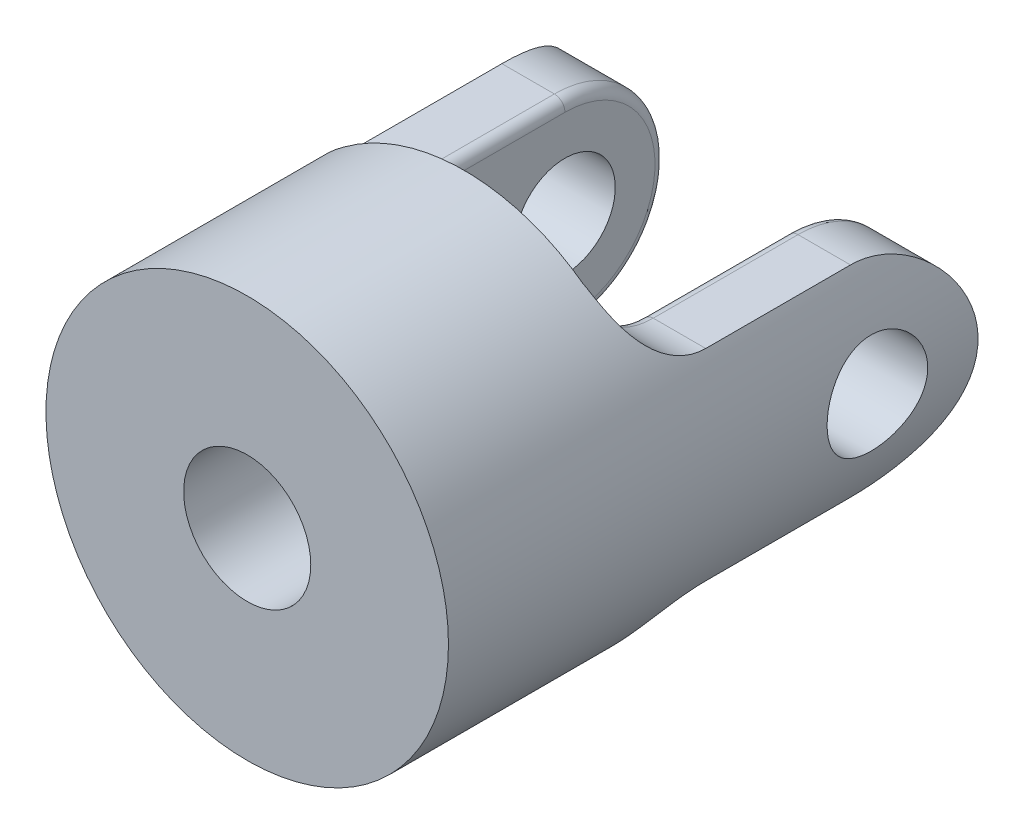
ISO-10303-21;
HEADER;
FILE_DESCRIPTION(('STEP AP214'),'2;1');
FILE_NAME('part.step','',(''),(''),'','','');
FILE_SCHEMA(('AUTOMOTIVE_DESIGN { 1 0 10303 214 1 1 1 1 }'));
ENDSEC;
DATA;
#1=APPLICATION_CONTEXT('core data for automotive mechanical design processes');
#2=APPLICATION_PROTOCOL_DEFINITION('international standard','automotive_design',2000,#1);
#3=PRODUCT_CONTEXT('',#1,'mechanical');
#4=PRODUCT('Part','Part','',(#3));
#5=PRODUCT_RELATED_PRODUCT_CATEGORY('part','',(#4));
#6=PRODUCT_DEFINITION_FORMATION('','',#4);
#7=PRODUCT_DEFINITION_CONTEXT('part definition',#1,'design');
#8=PRODUCT_DEFINITION('design','',#6,#7);
#9=PRODUCT_DEFINITION_SHAPE('','',#8);
#10=(LENGTH_UNIT() NAMED_UNIT(*) SI_UNIT(.MILLI.,.METRE.));
#11=(NAMED_UNIT(*) PLANE_ANGLE_UNIT() SI_UNIT($,.RADIAN.));
#12=(NAMED_UNIT(*) SI_UNIT($,.STERADIAN.) SOLID_ANGLE_UNIT());
#13=UNCERTAINTY_MEASURE_WITH_UNIT(LENGTH_MEASURE(1.E-05),#10,'distance_accuracy_value','');
#14=(GEOMETRIC_REPRESENTATION_CONTEXT(3) GLOBAL_UNCERTAINTY_ASSIGNED_CONTEXT((#13)) GLOBAL_UNIT_ASSIGNED_CONTEXT((#10,
#11,#12)) REPRESENTATION_CONTEXT('',''));
#15=CARTESIAN_POINT('',(0.,0.,0.));
#16=DIRECTION('',(0.,0.,1.));
#17=DIRECTION('',(1.,0.,0.));
#18=AXIS2_PLACEMENT_3D('',#15,#16,#17);
#19=CARTESIAN_POINT('',(0.,0.,50.));
#20=DIRECTION('',(0.,0.,-1.));
#21=DIRECTION('',(-1.,0.,0.));
#22=AXIS2_PLACEMENT_3D('',#19,#20,#21);
#23=CYLINDRICAL_SURFACE('',#22,19.);
#24=CARTESIAN_POINT('',(-19.,0.,14.25));
#25=CARTESIAN_POINT('',(-18.9999955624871,-0.262440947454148,14.2499926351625));
#26=CARTESIAN_POINT('',(-18.9945083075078,-0.524964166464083,14.228176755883));
#27=CARTESIAN_POINT('',(-18.97315027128,-1.04248669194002,14.1416203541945));
#28=CARTESIAN_POINT('',(-18.9572736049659,-1.29748164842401,14.0768555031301));
#29=CARTESIAN_POINT('',(-18.9168948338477,-1.79239942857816,13.9066090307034));
#30=CARTESIAN_POINT('',(-18.8924030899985,-2.03233995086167,13.8011763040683));
#31=CARTESIAN_POINT('',(-18.837402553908,-2.49112841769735,13.5527589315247));
#32=CARTESIAN_POINT('',(-18.806893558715,-2.70997565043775,13.4097730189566));
#33=CARTESIAN_POINT('',(-18.7424680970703,-3.12487276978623,13.0871974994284));
#34=CARTESIAN_POINT('',(-18.7084990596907,-3.32042635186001,12.9069800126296));
#35=CARTESIAN_POINT('',(-18.6413313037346,-3.67887160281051,12.5164013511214));
#36=CARTESIAN_POINT('',(-18.6081326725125,-3.84175958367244,12.3060367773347));
#37=CARTESIAN_POINT('',(-18.5457345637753,-4.13258405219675,11.8572817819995));
#38=CARTESIAN_POINT('',(-18.516601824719,-4.25996535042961,11.6185214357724));
#39=CARTESIAN_POINT('',(-18.4664006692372,-4.47259021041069,11.1221300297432));
#40=CARTESIAN_POINT('',(-18.4453309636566,-4.55784050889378,10.8645019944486));
#41=CARTESIAN_POINT('',(-18.4141817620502,-4.68209031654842,10.3431455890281));
#42=CARTESIAN_POINT('',(-18.4038905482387,-4.7219821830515,10.079642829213));
#43=CARTESIAN_POINT('',(-18.3948298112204,-4.75716228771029,9.54949953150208));
#44=CARTESIAN_POINT('',(-18.3960584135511,-4.75245778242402,9.28285951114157));
#45=CARTESIAN_POINT('',(-18.4097081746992,-4.69929066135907,8.76084994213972));
#46=CARTESIAN_POINT('',(-18.4218573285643,-4.65189141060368,8.50536386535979));
#47=CARTESIAN_POINT('',(-18.4555458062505,-4.51637659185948,8.00609000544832));
#48=CARTESIAN_POINT('',(-18.4770857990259,-4.42825812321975,7.76230305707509));
#49=CARTESIAN_POINT('',(-18.5273786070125,-4.21290001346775,7.29049628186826));
#50=CARTESIAN_POINT('',(-18.5562020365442,-4.08527444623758,7.0626604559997));
#51=CARTESIAN_POINT('',(-18.6177741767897,-3.79479487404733,6.6312574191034));
#52=CARTESIAN_POINT('',(-18.6505235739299,-3.63193470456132,6.42769446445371));
#53=CARTESIAN_POINT('',(-18.7174028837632,-3.27010084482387,6.04452188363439));
#54=CARTESIAN_POINT('',(-18.75154553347,-3.07022981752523,5.86576078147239));
#55=CARTESIAN_POINT('',(-18.8165222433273,-2.64293773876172,5.54413273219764));
#56=CARTESIAN_POINT('',(-18.8473562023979,-2.41551584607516,5.40126688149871));
#57=CARTESIAN_POINT('',(-18.9023948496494,-1.93836698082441,5.15517314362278));
#58=CARTESIAN_POINT('',(-18.9265764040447,-1.68856607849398,5.05208308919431));
#59=CARTESIAN_POINT('',(-18.9654173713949,-1.17444069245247,4.88959519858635));
#60=CARTESIAN_POINT('',(-18.9800786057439,-0.910118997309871,4.8301890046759));
#61=CARTESIAN_POINT('',(-18.9979574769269,-0.381709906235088,4.75805104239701));
#62=CARTESIAN_POINT('',(-19.0014583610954,-0.117789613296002,4.74416375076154));
#63=CARTESIAN_POINT('',(-18.9974288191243,0.408604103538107,4.76028850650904));
#64=CARTESIAN_POINT('',(-18.989899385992,0.671077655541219,4.79029660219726));
#65=CARTESIAN_POINT('',(-18.9648367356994,1.18311185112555,4.89240787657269));
#66=CARTESIAN_POINT('',(-18.9474534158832,1.4328062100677,4.96388066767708));
#67=CARTESIAN_POINT('',(-18.9046423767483,1.9166480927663,5.14617243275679));
#68=CARTESIAN_POINT('',(-18.8792138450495,2.15079404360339,5.2569953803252));
#69=CARTESIAN_POINT('',(-18.8224547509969,2.60148992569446,5.51708107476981));
#70=CARTESIAN_POINT('',(-18.7910274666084,2.81765389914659,5.66699102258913));
#71=CARTESIAN_POINT('',(-18.7259094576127,3.22216760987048,6.00016804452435));
#72=CARTESIAN_POINT('',(-18.6922183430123,3.41051253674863,6.18344087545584));
#73=CARTESIAN_POINT('',(-18.6253503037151,3.75880346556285,6.58350620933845));
#74=CARTESIAN_POINT('',(-18.592206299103,3.91793891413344,6.80101105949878));
#75=CARTESIAN_POINT('',(-18.5311078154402,4.19745073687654,7.26032000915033));
#76=CARTESIAN_POINT('',(-18.5031531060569,4.31782883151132,7.50212302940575));
#77=CARTESIAN_POINT('',(-18.4559063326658,4.51551283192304,8.00186812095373));
#78=CARTESIAN_POINT('',(-18.4365630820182,4.59307392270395,8.25970415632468));
#79=CARTESIAN_POINT('',(-18.4086802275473,4.70359458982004,8.78531385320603));
#80=CARTESIAN_POINT('',(-18.4001382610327,4.73656392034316,9.05308532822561));
#81=CARTESIAN_POINT('',(-18.3950052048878,4.75645553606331,9.5827165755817));
#82=CARTESIAN_POINT('',(-18.3980778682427,4.7446733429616,9.84452521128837));
#83=CARTESIAN_POINT('',(-18.4150504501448,4.67836138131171,10.362295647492));
#84=CARTESIAN_POINT('',(-18.428950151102,4.62383247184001,10.6182575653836));
#85=CARTESIAN_POINT('',(-18.4658232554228,4.47428251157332,11.1156601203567));
#86=CARTESIAN_POINT('',(-18.4887421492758,4.37950444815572,11.3571781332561));
#87=CARTESIAN_POINT('',(-18.5410789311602,4.15233889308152,11.8210570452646));
#88=CARTESIAN_POINT('',(-18.570497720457,4.01994618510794,12.0434152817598));
#89=CARTESIAN_POINT('',(-18.6334784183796,3.7172478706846,12.4689229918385));
#90=CARTESIAN_POINT('',(-18.6671283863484,3.54604334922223,12.6714200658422));
#91=CARTESIAN_POINT('',(-18.734254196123,3.17233300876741,13.0452323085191));
#92=CARTESIAN_POINT('',(-18.7677299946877,2.96981976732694,13.2165400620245));
#93=CARTESIAN_POINT('',(-18.8314590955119,2.53481402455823,13.5261358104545));
#94=CARTESIAN_POINT('',(-18.8616430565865,2.3018450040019,13.66376960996));
#95=CARTESIAN_POINT('',(-18.9146559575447,1.81534252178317,13.8977002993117));
#96=CARTESIAN_POINT('',(-18.9374901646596,1.56182395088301,13.9940268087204));
#97=CARTESIAN_POINT('',(-18.9698552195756,1.09063246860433,14.1283107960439));
#98=CARTESIAN_POINT('',(-18.9810818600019,0.875203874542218,14.1738456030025));
#99=CARTESIAN_POINT('',(-18.996155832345,0.439869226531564,14.2346921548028));
#100=CARTESIAN_POINT('',(-19.0000037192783,0.219963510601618,14.2500061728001));
#101=CARTESIAN_POINT('',(-19.,0.,14.25));
#102=B_SPLINE_CURVE_WITH_KNOTS('',3,(#24,#25,#26,#27,#28,#29,#30,#31,#32,#33,#34,#35,#36,#37,
#38,#39,#40,#41,#42,#43,#44,#45,#46,#47,#48,#49,#50,#51,#52,#53,#54,#55,#56,#57,#58,#59,#60,#61,
#62,#63,#64,#65,#66,#67,#68,#69,#70,#71,#72,#73,#74,#75,#76,#77,#78,#79,#80,#81,#82,#83,#84,#85,
#86,#87,#88,#89,#90,#91,#92,#93,#94,#95,#96,#97,#98,#99,#100,#101),.UNSPECIFIED.,.T.,.F.,(4,2,2,
2,2,2,2,2,2,2,2,2,2,2,2,2,2,2,2,2,2,2,2,2,2,2,2,2,2,2,2,2,2,2,2,2,2,2,4),(0.,0.786516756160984,
1.57347941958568,2.35949885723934,3.1455448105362,3.94612378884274,4.74679310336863,
5.55935717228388,6.37179127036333,7.16794934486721,7.96397787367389,8.74071240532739,
9.5175022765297,10.302133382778,11.0869018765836,11.8940475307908,12.7012178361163,
13.5111605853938,14.3209483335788,15.1100131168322,15.8990068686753,16.6763086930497,
17.4536890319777,18.2448636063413,19.0361748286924,19.8469094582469,20.6576080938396,
21.4634213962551,22.2690584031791,23.0515530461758,23.8340319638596,24.6118526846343,
25.389781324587,26.1880032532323,26.9864147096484,27.7992858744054,28.6115731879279,
29.2708376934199,29.9300526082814),.UNSPECIFIED.);
#103=CARTESIAN_POINT('',(-19.,0.,14.25));
#104=VERTEX_POINT('',#103);
#105=EDGE_CURVE('E269',#104,#104,#102,.T.);
#106=ORIENTED_EDGE('',*,*,#105,.T.);
#107=EDGE_LOOP('',(#106));
#108=FACE_BOUND('',#107,.T.);
#109=CARTESIAN_POINT('',(19.,0.,4.75));
#110=CARTESIAN_POINT('',(18.9999955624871,-0.262440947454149,4.7500073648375));
#111=CARTESIAN_POINT('',(18.9945083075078,-0.524964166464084,4.77182324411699));
#112=CARTESIAN_POINT('',(18.97315027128,-1.04248669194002,4.85837964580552));
#113=CARTESIAN_POINT('',(18.9572736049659,-1.29748164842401,4.92314449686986));
#114=CARTESIAN_POINT('',(18.9168948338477,-1.79239942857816,5.0933909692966));
#115=CARTESIAN_POINT('',(18.8924030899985,-2.03233995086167,5.19882369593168));
#116=CARTESIAN_POINT('',(18.837402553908,-2.49112841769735,5.44724106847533));
#117=CARTESIAN_POINT('',(18.806893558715,-2.70997565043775,5.5902269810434));
#118=CARTESIAN_POINT('',(18.7424680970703,-3.12487276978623,5.91280250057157));
#119=CARTESIAN_POINT('',(18.7084990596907,-3.32042635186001,6.09301998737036));
#120=CARTESIAN_POINT('',(18.6413313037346,-3.67887160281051,6.48359864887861));
#121=CARTESIAN_POINT('',(18.6081326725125,-3.84175958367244,6.6939632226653));
#122=CARTESIAN_POINT('',(18.5457345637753,-4.13258405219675,7.14271821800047));
#123=CARTESIAN_POINT('',(18.516601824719,-4.25996535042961,7.38147856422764));
#124=CARTESIAN_POINT('',(18.4664006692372,-4.47259021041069,7.87786997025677));
#125=CARTESIAN_POINT('',(18.4453309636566,-4.55784050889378,8.13549800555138));
#126=CARTESIAN_POINT('',(18.4141817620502,-4.68209031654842,8.65685441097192));
#127=CARTESIAN_POINT('',(18.4038905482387,-4.7219821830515,8.92035717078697));
#128=CARTESIAN_POINT('',(18.3948298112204,-4.75716228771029,9.45050046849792));
#129=CARTESIAN_POINT('',(18.3960584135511,-4.75245778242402,9.71714048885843));
#130=CARTESIAN_POINT('',(18.4097081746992,-4.69929066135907,10.2391500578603));
#131=CARTESIAN_POINT('',(18.4218573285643,-4.65189141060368,10.4946361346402));
#132=CARTESIAN_POINT('',(18.4555458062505,-4.51637659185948,10.9939099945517));
#133=CARTESIAN_POINT('',(18.4770857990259,-4.42825812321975,11.2376969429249));
#134=CARTESIAN_POINT('',(18.5273786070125,-4.21290001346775,11.7095037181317));
#135=CARTESIAN_POINT('',(18.5562020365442,-4.08527444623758,11.9373395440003));
#136=CARTESIAN_POINT('',(18.6177741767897,-3.79479487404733,12.3687425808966));
#137=CARTESIAN_POINT('',(18.6505235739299,-3.63193470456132,12.5723055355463));
#138=CARTESIAN_POINT('',(18.7174028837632,-3.27010084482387,12.9554781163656));
#139=CARTESIAN_POINT('',(18.75154553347,-3.07022981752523,13.1342392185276));
#140=CARTESIAN_POINT('',(18.8165222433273,-2.64293773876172,13.4558672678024));
#141=CARTESIAN_POINT('',(18.8473562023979,-2.41551584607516,13.5987331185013));
#142=CARTESIAN_POINT('',(18.9023948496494,-1.93836698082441,13.8448268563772));
#143=CARTESIAN_POINT('',(18.9265764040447,-1.68856607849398,13.9479169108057));
#144=CARTESIAN_POINT('',(18.9654173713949,-1.17444069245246,14.1104048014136));
#145=CARTESIAN_POINT('',(18.9800786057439,-0.910118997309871,14.1698109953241));
#146=CARTESIAN_POINT('',(18.9979574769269,-0.381709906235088,14.241948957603));
#147=CARTESIAN_POINT('',(19.0014583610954,-0.117789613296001,14.2558362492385));
#148=CARTESIAN_POINT('',(18.9974288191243,0.408604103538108,14.239711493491));
#149=CARTESIAN_POINT('',(18.989899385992,0.671077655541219,14.2097033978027));
#150=CARTESIAN_POINT('',(18.9648367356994,1.18311185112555,14.1075921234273));
#151=CARTESIAN_POINT('',(18.9474534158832,1.43280621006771,14.0361193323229));
#152=CARTESIAN_POINT('',(18.9046423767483,1.9166480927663,13.8538275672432));
#153=CARTESIAN_POINT('',(18.8792138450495,2.15079404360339,13.7430046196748));
#154=CARTESIAN_POINT('',(18.8224547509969,2.60148992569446,13.4829189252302));
#155=CARTESIAN_POINT('',(18.7910274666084,2.81765389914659,13.3330089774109));
#156=CARTESIAN_POINT('',(18.7259094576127,3.22216760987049,12.9998319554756));
#157=CARTESIAN_POINT('',(18.6922183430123,3.41051253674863,12.8165591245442));
#158=CARTESIAN_POINT('',(18.6253503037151,3.75880346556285,12.4164937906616));
#159=CARTESIAN_POINT('',(18.592206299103,3.91793891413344,12.1989889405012));
#160=CARTESIAN_POINT('',(18.5311078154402,4.19745073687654,11.7396799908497));
#161=CARTESIAN_POINT('',(18.5031531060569,4.31782883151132,11.4978769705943));
#162=CARTESIAN_POINT('',(18.4559063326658,4.51551283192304,10.9981318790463));
#163=CARTESIAN_POINT('',(18.4365630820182,4.59307392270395,10.7402958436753));
#164=CARTESIAN_POINT('',(18.4086802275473,4.70359458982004,10.214686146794));
#165=CARTESIAN_POINT('',(18.4001382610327,4.73656392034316,9.94691467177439));
#166=CARTESIAN_POINT('',(18.3950052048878,4.75645553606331,9.4172834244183));
#167=CARTESIAN_POINT('',(18.3980778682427,4.74467334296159,9.15547478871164));
#168=CARTESIAN_POINT('',(18.4150504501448,4.67836138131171,8.63770435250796));
#169=CARTESIAN_POINT('',(18.428950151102,4.62383247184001,8.38174243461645));
#170=CARTESIAN_POINT('',(18.4658232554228,4.47428251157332,7.88433987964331));
#171=CARTESIAN_POINT('',(18.4887421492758,4.37950444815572,7.64282186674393));
#172=CARTESIAN_POINT('',(18.5410789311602,4.15233889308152,7.1789429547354));
#173=CARTESIAN_POINT('',(18.570497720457,4.01994618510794,6.95658471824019));
#174=CARTESIAN_POINT('',(18.6334784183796,3.7172478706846,6.53107700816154));
#175=CARTESIAN_POINT('',(18.6671283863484,3.54604334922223,6.32857993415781));
#176=CARTESIAN_POINT('',(18.734254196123,3.1723330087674,5.95476769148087));
#177=CARTESIAN_POINT('',(18.7677299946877,2.96981976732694,5.78345993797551));
#178=CARTESIAN_POINT('',(18.8314590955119,2.53481402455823,5.47386418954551));
#179=CARTESIAN_POINT('',(18.8616430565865,2.3018450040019,5.33623039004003));
#180=CARTESIAN_POINT('',(18.9146559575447,1.81534252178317,5.1022997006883));
#181=CARTESIAN_POINT('',(18.9374901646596,1.56182395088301,5.00597319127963));
#182=CARTESIAN_POINT('',(18.9698552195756,1.09063246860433,4.8716892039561));
#183=CARTESIAN_POINT('',(18.9810818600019,0.875203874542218,4.82615439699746));
#184=CARTESIAN_POINT('',(18.996155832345,0.439869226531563,4.76530784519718));
#185=CARTESIAN_POINT('',(19.0000037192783,0.219963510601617,4.74999382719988));
#186=CARTESIAN_POINT('',(19.,0.,4.75));
#187=B_SPLINE_CURVE_WITH_KNOTS('',3,(#109,#110,#111,#112,#113,#114,#115,#116,#117,#118,#119,
#120,#121,#122,#123,#124,#125,#126,#127,#128,#129,#130,#131,#132,#133,#134,#135,#136,#137,#138,
#139,#140,#141,#142,#143,#144,#145,#146,#147,#148,#149,#150,#151,#152,#153,#154,#155,#156,#157,
#158,#159,#160,#161,#162,#163,#164,#165,#166,#167,#168,#169,#170,#171,#172,#173,#174,#175,#176,
#177,#178,#179,#180,#181,#182,#183,#184,#185,#186),.UNSPECIFIED.,.T.,.F.,(4,2,2,2,2,2,2,2,2,2,2,
2,2,2,2,2,2,2,2,2,2,2,2,2,2,2,2,2,2,2,2,2,2,2,2,2,2,2,4),(0.,0.786516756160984,1.57347941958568,
2.35949885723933,3.1455448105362,3.94612378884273,4.74679310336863,5.55935717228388,
6.37179127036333,7.16794934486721,7.96397787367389,8.7407124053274,9.51750227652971,
10.302133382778,11.0869018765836,11.8940475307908,12.7012178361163,13.5111605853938,
14.3209483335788,15.1100131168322,15.8990068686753,16.6763086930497,17.4536890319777,
18.2448636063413,19.0361748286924,19.8469094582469,20.6576080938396,21.4634213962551,
22.2690584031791,23.0515530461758,23.8340319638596,24.6118526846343,25.389781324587,
26.1880032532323,26.9864147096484,27.7992858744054,28.6115731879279,29.2708376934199,
29.9300526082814),.UNSPECIFIED.);
#188=CARTESIAN_POINT('',(19.,0.,4.75));
#189=VERTEX_POINT('',#188);
#190=EDGE_CURVE('E265',#189,#189,#187,.T.);
#191=ORIENTED_EDGE('',*,*,#190,.T.);
#192=EDGE_LOOP('',(#191));
#193=FACE_BOUND('',#192,.T.);
#194=CARTESIAN_POINT('',(0.,0.,50.));
#195=DIRECTION('',(0.,0.,1.));
#196=DIRECTION('',(1.,0.,0.));
#197=AXIS2_PLACEMENT_3D('',#194,#195,#196);
#198=CIRCLE('',#197,19.);
#199=CARTESIAN_POINT('',(19.,0.,50.));
#200=VERTEX_POINT('',#199);
#201=EDGE_CURVE('E278',#200,#200,#198,.T.);
#202=ORIENTED_EDGE('',*,*,#201,.F.);
#203=EDGE_LOOP('',(#202));
#204=FACE_BOUND('',#203,.T.);
#205=CARTESIAN_POINT('',(0.,0.,29.5));
#206=DIRECTION('',(0.,0.,1.));
#207=DIRECTION('',(1.,0.,0.));
#208=AXIS2_PLACEMENT_3D('',#205,#206,#207);
#209=CIRCLE('',#208,19.);
#210=CARTESIAN_POINT('',(11.2835872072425,15.2866170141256,29.5));
#211=VERTEX_POINT('',#210);
#212=CARTESIAN_POINT('',(-11.2835872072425,15.2866170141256,29.5));
#213=VERTEX_POINT('',#212);
#214=EDGE_CURVE('E285',#211,#213,#209,.T.);
#215=ORIENTED_EDGE('',*,*,#214,.T.);
#216=CARTESIAN_POINT('',(-11.2835872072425,15.2866170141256,29.5));
#217=CARTESIAN_POINT('',(-11.3194268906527,15.2601671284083,29.4897745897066));
#218=CARTESIAN_POINT('',(-11.3553811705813,15.2334310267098,29.4813301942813));
#219=CARTESIAN_POINT('',(-11.4275187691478,15.1793865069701,29.4680034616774));
#220=CARTESIAN_POINT('',(-11.463702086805,15.1520780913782,29.4631211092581));
#221=CARTESIAN_POINT('',(-11.5,15.1244834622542,29.4600197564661));
#222=B_SPLINE_CURVE_WITH_KNOTS('',3,(#216,#217,#218,#219,#220,#221),.UNSPECIFIED.,.F.,.F.,(4,2,
4),(0.,0.136782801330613,0.273565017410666),.UNSPECIFIED.);
#223=CARTESIAN_POINT('',(-11.5,15.1244834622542,29.4600197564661));
#224=VERTEX_POINT('',#223);
#225=EDGE_CURVE('E372',#213,#224,#222,.T.);
#226=ORIENTED_EDGE('',*,*,#225,.T.);
#227=CARTESIAN_POINT('',(-10.5,15.8350876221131,29.5));
#228=CARTESIAN_POINT('',(-10.7211976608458,15.6884450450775,29.4999759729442));
#229=CARTESIAN_POINT('',(-10.9393799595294,15.5370706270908,29.4949043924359));
#230=CARTESIAN_POINT('',(-11.3691239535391,15.2254171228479,29.4725405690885));
#231=CARTESIAN_POINT('',(-11.5806752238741,15.0651250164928,29.4552300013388));
#232=CARTESIAN_POINT('',(-11.9979507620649,14.7350159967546,29.4060078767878));
#233=CARTESIAN_POINT('',(-12.203596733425,14.5651205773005,29.373953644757));
#234=CARTESIAN_POINT('',(-12.6055775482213,14.2186399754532,29.2928865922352));
#235=CARTESIAN_POINT('',(-12.8019178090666,14.0420587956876,29.2438837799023));
#236=CARTESIAN_POINT('',(-13.1462518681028,13.7193379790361,29.1381682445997));
#237=CARTESIAN_POINT('',(-13.2961298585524,13.5740816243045,29.0848949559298));
#238=CARTESIAN_POINT('',(-13.5883012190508,13.2815949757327,28.9647396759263));
#239=CARTESIAN_POINT('',(-13.7305961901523,13.1343651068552,28.8978605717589));
#240=CARTESIAN_POINT('',(-14.0063151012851,12.8399251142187,28.7496598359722));
#241=CARTESIAN_POINT('',(-14.1397682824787,12.6927167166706,28.6683894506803));
#242=CARTESIAN_POINT('',(-14.397482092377,12.3996195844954,28.4903491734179));
#243=CARTESIAN_POINT('',(-14.5217443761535,12.2537306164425,28.3935820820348));
#244=CARTESIAN_POINT('',(-14.7415540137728,11.9879734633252,28.2003517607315));
#245=CARTESIAN_POINT('',(-14.8385500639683,11.8676095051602,28.1062161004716));
#246=CARTESIAN_POINT('',(-15.0249342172,11.63073738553,27.9063026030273));
#247=CARTESIAN_POINT('',(-15.1143238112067,11.5142284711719,27.8005270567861));
#248=CARTESIAN_POINT('',(-15.2851191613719,11.2865142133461,27.5773089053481));
#249=CARTESIAN_POINT('',(-15.3665215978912,11.1753110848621,27.4598614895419));
#250=CARTESIAN_POINT('',(-15.5209407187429,10.9598345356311,27.2136165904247));
#251=CARTESIAN_POINT('',(-15.5939573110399,10.8555611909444,27.0848189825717));
#252=CARTESIAN_POINT('',(-15.7317099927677,10.6549610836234,26.8156591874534));
#253=CARTESIAN_POINT('',(-15.7963967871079,10.5586827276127,26.6752355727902));
#254=CARTESIAN_POINT('',(-15.9168008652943,10.3762902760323,26.3842826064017));
#255=CARTESIAN_POINT('',(-15.9725179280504,10.2901764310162,26.2337530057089));
#256=CARTESIAN_POINT('',(-16.0748457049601,10.1295807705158,25.9237157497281));
#257=CARTESIAN_POINT('',(-16.1214591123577,10.0550955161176,25.7642107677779));
#258=CARTESIAN_POINT('',(-16.2055473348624,9.91900406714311,25.4374878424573));
#259=CARTESIAN_POINT('',(-16.2430230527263,9.8573966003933,25.2702706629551));
#260=CARTESIAN_POINT('',(-16.3057026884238,9.75332722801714,24.9458455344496));
#261=CARTESIAN_POINT('',(-16.3317355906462,9.70960050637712,24.789201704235));
#262=CARTESIAN_POINT('',(-16.3763457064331,9.63416897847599,24.472015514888));
#263=CARTESIAN_POINT('',(-16.3949236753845,9.60246295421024,24.3114735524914));
#264=CARTESIAN_POINT('',(-16.4246937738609,9.55145859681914,23.9872936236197));
#265=CARTESIAN_POINT('',(-16.4358652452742,9.53219497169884,23.823648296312));
#266=CARTESIAN_POINT('',(-16.450759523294,9.50644761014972,23.4949754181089));
#267=CARTESIAN_POINT('',(-16.454480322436,9.49996731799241,23.3299475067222));
#268=CARTESIAN_POINT('',(-16.4544826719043,9.5,23.1649123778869));
#269=B_SPLINE_CURVE_WITH_KNOTS('',3,(#227,#228,#229,#230,#231,#232,#233,#234,#235,#236,#237,
#238,#239,#240,#241,#242,#243,#244,#245,#246,#247,#248,#249,#250,#251,#252,#253,#254,#255,#256,
#257,#258,#259,#260,#261,#262,#263,#264,#265,#266,#267,#268),.UNSPECIFIED.,.F.,.F.,(4,2,2,2,2,2,
2,2,2,2,2,2,2,2,2,2,2,2,2,2,4),(0.,0.796220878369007,1.59363643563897,2.39893645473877,
3.2037617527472,3.84947618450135,4.49505373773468,5.13837704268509,5.78158421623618,
6.32402054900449,6.86635031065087,7.40890453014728,7.95146470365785,8.49710102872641,
9.04275080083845,9.5882389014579,10.1336730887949,10.6271444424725,11.1205657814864,
11.6153576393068,12.1102827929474),.UNSPECIFIED.);
#270=CARTESIAN_POINT('',(-16.4544826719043,9.5,23.1649123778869));
#271=VERTEX_POINT('',#270);
#272=EDGE_CURVE('E243',#224,#271,#269,.T.);
#273=ORIENTED_EDGE('',*,*,#272,.T.);
#274=DIRECTION('',(0.,0.,-1.));
#275=VECTOR('',#274,1.);
#276=CARTESIAN_POINT('',(-16.4544826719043,9.5,50.));
#277=LINE('',#276,#275);
#278=CARTESIAN_POINT('',(-16.4544826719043,9.5,9.5));
#279=VERTEX_POINT('',#278);
#280=EDGE_CURVE('E167',#271,#279,#277,.T.);
#281=ORIENTED_EDGE('',*,*,#280,.T.);
#282=CARTESIAN_POINT('',(-16.4544826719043,9.5,9.5));
#283=CARTESIAN_POINT('',(-16.4544798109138,9.50000093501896,9.37559946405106));
#284=CARTESIAN_POINT('',(-16.4558940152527,9.49755596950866,9.25121647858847));
#285=CARTESIAN_POINT('',(-16.4615272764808,9.48779036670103,9.00271080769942));
#286=CARTESIAN_POINT('',(-16.4657462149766,9.48046993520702,8.87858811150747));
#287=CARTESIAN_POINT('',(-16.4825568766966,9.45123588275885,8.50714286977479));
#288=CARTESIAN_POINT('',(-16.4993025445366,9.42204944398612,8.26053115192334));
#289=CARTESIAN_POINT('',(-16.5431196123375,9.34489858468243,7.77270911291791));
#290=CARTESIAN_POINT('',(-16.5701311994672,9.29704289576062,7.53147591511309));
#291=CARTESIAN_POINT('',(-16.6335264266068,9.183138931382,7.05458257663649));
#292=CARTESIAN_POINT('',(-16.6699111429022,9.1170885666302,6.81892307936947));
#293=CARTESIAN_POINT('',(-16.7507499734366,8.96769538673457,6.35522164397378));
#294=CARTESIAN_POINT('',(-16.7951846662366,8.88439412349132,6.12716290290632));
#295=CARTESIAN_POINT('',(-16.890831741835,8.70117662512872,5.67924957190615));
#296=CARTESIAN_POINT('',(-16.9420467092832,8.60125405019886,5.45939815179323));
#297=CARTESIAN_POINT('',(-17.103829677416,8.27751737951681,4.81334164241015));
#298=CARTESIAN_POINT('',(-17.2224882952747,8.02981801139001,4.40089126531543));
#299=CARTESIAN_POINT('',(-17.4797396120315,7.4542361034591,3.58795042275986));
#300=CARTESIAN_POINT('',(-17.6191689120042,7.12145450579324,3.19119305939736));
#301=CARTESIAN_POINT('',(-17.826294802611,6.57731676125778,2.6402852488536));
#302=CARTESIAN_POINT('',(-17.8950376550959,6.38832701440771,2.46393592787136));
#303=CARTESIAN_POINT('',(-18.0302604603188,5.99605651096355,2.12679467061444));
#304=CARTESIAN_POINT('',(-18.0967400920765,5.79277373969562,1.9660049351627));
#305=CARTESIAN_POINT('',(-18.2302055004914,5.35860504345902,1.65065779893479));
#306=CARTESIAN_POINT('',(-18.2969168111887,5.12678209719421,1.49727256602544));
#307=CARTESIAN_POINT('',(-18.4240122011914,4.64938138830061,1.21080834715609));
#308=CARTESIAN_POINT('',(-18.4843988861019,4.40380935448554,1.0777209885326));
#309=CARTESIAN_POINT('',(-18.5970919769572,3.90058920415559,0.833189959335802));
#310=CARTESIAN_POINT('',(-18.6494050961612,3.64295135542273,0.721728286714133));
#311=CARTESIAN_POINT('',(-18.7444335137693,3.11728784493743,0.521606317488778));
#312=CARTESIAN_POINT('',(-18.787151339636,2.84926494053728,0.43294001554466));
#313=CARTESIAN_POINT('',(-18.8529118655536,2.36895042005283,0.297560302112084));
#314=CARTESIAN_POINT('',(-18.8782191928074,2.15835204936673,0.245884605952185));
#315=CARTESIAN_POINT('',(-18.9219657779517,1.733436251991,0.156965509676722));
#316=CARTESIAN_POINT('',(-18.9404058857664,1.51911928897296,0.119720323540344));
#317=CARTESIAN_POINT('',(-18.9700570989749,1.08794731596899,0.0599926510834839));
#318=CARTESIAN_POINT('',(-18.9812684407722,0.871092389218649,0.0375096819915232));
#319=CARTESIAN_POINT('',(-18.9962391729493,0.436162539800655,0.00751512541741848));
#320=CARTESIAN_POINT('',(-19.0000007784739,0.218087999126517,-9.12416643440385E-07));
#321=CARTESIAN_POINT('',(-18.9999991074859,-0.25003614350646,1.0460783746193E-06));
#322=CARTESIAN_POINT('',(-18.9950527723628,-0.500089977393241,0.00988270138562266));
#323=CARTESIAN_POINT('',(-18.9753952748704,-0.998267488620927,0.0492903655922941));
#324=CARTESIAN_POINT('',(-18.9606832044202,-1.24639098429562,0.0788182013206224));
#325=CARTESIAN_POINT('',(-18.9218690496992,-1.73894564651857,0.157179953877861));
#326=CARTESIAN_POINT('',(-18.8977623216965,-1.98337492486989,0.206023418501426));
#327=CARTESIAN_POINT('',(-18.8407741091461,-2.46666642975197,0.32245439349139));
#328=CARTESIAN_POINT('',(-18.8078927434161,-2.70552873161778,0.390041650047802));
#329=CARTESIAN_POINT('',(-18.7342995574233,-3.17527035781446,0.542966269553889));
#330=CARTESIAN_POINT('',(-18.6936164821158,-3.40617542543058,0.628238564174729));
#331=CARTESIAN_POINT('',(-18.6052853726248,-3.85962944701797,0.815905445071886));
#332=CARTESIAN_POINT('',(-18.5576347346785,-4.08217523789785,0.91830643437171));
#333=CARTESIAN_POINT('',(-18.4564734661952,-4.51758023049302,1.13931457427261));
#334=CARTESIAN_POINT('',(-18.402964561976,-4.73044225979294,1.25791695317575));
#335=CARTESIAN_POINT('',(-18.2912190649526,-5.14563428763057,1.51053623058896));
#336=CARTESIAN_POINT('',(-18.2329803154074,-5.34795941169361,1.64456017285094));
#337=CARTESIAN_POINT('',(-18.1094292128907,-5.75291540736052,1.93562174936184));
#338=CARTESIAN_POINT('',(-18.0439020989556,-5.95483500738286,2.09355807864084));
#339=CARTESIAN_POINT('',(-17.9104896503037,-6.34482815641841,2.42478849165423));
#340=CARTESIAN_POINT('',(-17.8426041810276,-6.53290091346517,2.59808345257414));
#341=CARTESIAN_POINT('',(-17.70603157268,-6.8944776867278,2.95924181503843));
#342=CARTESIAN_POINT('',(-17.6373438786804,-7.06797084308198,3.14711587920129));
#343=CARTESIAN_POINT('',(-17.5008743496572,-7.39942767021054,3.53645686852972));
#344=CARTESIAN_POINT('',(-17.4330926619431,-7.55738884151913,3.73792597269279));
#345=CARTESIAN_POINT('',(-17.2949403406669,-7.86868939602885,4.16989143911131));
#346=CARTESIAN_POINT('',(-17.2247849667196,-8.02068963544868,4.40142467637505));
#347=CARTESIAN_POINT('',(-17.0897993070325,-8.3044231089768,4.87794294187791));
#348=CARTESIAN_POINT('',(-17.0249667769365,-8.43616490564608,5.1229222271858));
#349=CARTESIAN_POINT('',(-16.9029385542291,-8.67807594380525,5.62463811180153));
#350=CARTESIAN_POINT('',(-16.8457306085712,-8.78827993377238,5.88135493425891));
#351=CARTESIAN_POINT('',(-16.7410234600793,-8.98613851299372,6.40522202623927));
#352=CARTESIAN_POINT('',(-16.6935214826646,-9.07379954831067,6.67236928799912));
#353=CARTESIAN_POINT('',(-16.6202533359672,-9.20714270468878,7.14962472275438));
#354=CARTESIAN_POINT('',(-16.5920078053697,-9.25785030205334,7.35796275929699));
#355=CARTESIAN_POINT('',(-16.5429835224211,-9.34516960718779,7.77840549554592));
#356=CARTESIAN_POINT('',(-16.5222029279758,-9.38178479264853,7.99050925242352));
#357=CARTESIAN_POINT('',(-16.4886330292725,-9.44066748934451,8.41810300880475));
#358=CARTESIAN_POINT('',(-16.4758723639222,-9.46288359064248,8.63360235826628));
#359=CARTESIAN_POINT('',(-16.4587731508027,-9.49256746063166,9.06606091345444));
#360=CARTESIAN_POINT('',(-16.4544391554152,-9.50002725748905,9.28302084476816));
#361=CARTESIAN_POINT('',(-16.4544826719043,-9.5,9.5));
#362=B_SPLINE_CURVE_WITH_KNOTS('',3,(#282,#283,#284,#285,#286,#287,#288,#289,#290,#291,#292,
#293,#294,#295,#296,#297,#298,#299,#300,#301,#302,#303,#304,#305,#306,#307,#308,#309,#310,#311,
#312,#313,#314,#315,#316,#317,#318,#319,#320,#321,#322,#323,#324,#325,#326,#327,#328,#329,#330,
#331,#332,#333,#334,#335,#336,#337,#338,#339,#340,#341,#342,#343,#344,#345,#346,#347,#348,#349,
#350,#351,#352,#353,#354,#355,#356,#357,#358,#359,#360,#361),.UNSPECIFIED.,.F.,.F.,(4,2,2,2,2,2,
2,2,2,2,2,2,2,2,2,2,2,2,2,2,2,2,2,2,2,2,2,2,2,2,2,2,2,2,2,2,2,2,2,4),(0.,0.373134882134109,
0.746254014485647,1.49185857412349,2.23318397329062,2.9745945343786,3.71423962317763,
4.45416748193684,5.93483715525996,7.53653194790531,8.33826125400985,9.1401037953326,
9.99661067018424,10.8527632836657,11.7082001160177,12.5634113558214,13.2177876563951,
13.8720829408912,14.5263568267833,15.180436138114,15.9303328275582,16.6802992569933,
17.4306368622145,18.1809643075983,18.9285785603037,19.6764729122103,20.4241474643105,
21.1721648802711,21.9651022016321,22.7580848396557,23.5516530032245,24.3453486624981,
25.2014286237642,26.0571457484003,26.9114706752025,27.7655510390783,28.413793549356,
29.0618759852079,29.7122597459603,30.3629947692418),.UNSPECIFIED.);
#363=CARTESIAN_POINT('',(-16.4544826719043,-9.5,9.5));
#364=VERTEX_POINT('',#363);
#365=EDGE_CURVE('E162',#279,#364,#362,.T.);
#366=ORIENTED_EDGE('',*,*,#365,.T.);
#367=DIRECTION('',(0.,0.,-1.));
#368=VECTOR('',#367,1.);
#369=CARTESIAN_POINT('',(-16.4544826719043,-9.5,50.));
#370=LINE('',#369,#368);
#371=CARTESIAN_POINT('',(-16.4544826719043,-9.5,23.1649123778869));
#372=VERTEX_POINT('',#371);
#373=EDGE_CURVE('E165',#372,#364,#370,.T.);
#374=ORIENTED_EDGE('',*,*,#373,.F.);
#375=CARTESIAN_POINT('',(-10.5,-15.8350876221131,29.5));
#376=CARTESIAN_POINT('',(-10.7211976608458,-15.6884450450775,29.4999759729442));
#377=CARTESIAN_POINT('',(-10.9393799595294,-15.5370706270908,29.4949043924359));
#378=CARTESIAN_POINT('',(-11.3691239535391,-15.2254171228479,29.4725405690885));
#379=CARTESIAN_POINT('',(-11.5806752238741,-15.0651250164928,29.4552300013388));
#380=CARTESIAN_POINT('',(-11.9979507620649,-14.7350159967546,29.4060078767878));
#381=CARTESIAN_POINT('',(-12.203596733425,-14.5651205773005,29.373953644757));
#382=CARTESIAN_POINT('',(-12.6055775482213,-14.2186399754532,29.2928865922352));
#383=CARTESIAN_POINT('',(-12.8019178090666,-14.0420587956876,29.2438837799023));
#384=CARTESIAN_POINT('',(-13.1462518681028,-13.7193379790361,29.1381682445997));
#385=CARTESIAN_POINT('',(-13.2961298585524,-13.5740816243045,29.0848949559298));
#386=CARTESIAN_POINT('',(-13.5883012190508,-13.2815949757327,28.9647396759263));
#387=CARTESIAN_POINT('',(-13.7305961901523,-13.1343651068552,28.8978605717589));
#388=CARTESIAN_POINT('',(-14.0063151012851,-12.8399251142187,28.7496598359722));
#389=CARTESIAN_POINT('',(-14.1397682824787,-12.6927167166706,28.6683894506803));
#390=CARTESIAN_POINT('',(-14.397482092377,-12.3996195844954,28.4903491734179));
#391=CARTESIAN_POINT('',(-14.5217443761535,-12.2537306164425,28.3935820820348));
#392=CARTESIAN_POINT('',(-14.7415540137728,-11.9879734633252,28.2003517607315));
#393=CARTESIAN_POINT('',(-14.8385500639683,-11.8676095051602,28.1062161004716));
#394=CARTESIAN_POINT('',(-15.0249342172,-11.63073738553,27.9063026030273));
#395=CARTESIAN_POINT('',(-15.1143238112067,-11.5142284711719,27.8005270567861));
#396=CARTESIAN_POINT('',(-15.2851191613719,-11.2865142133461,27.5773089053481));
#397=CARTESIAN_POINT('',(-15.3665215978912,-11.1753110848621,27.4598614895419));
#398=CARTESIAN_POINT('',(-15.5209407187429,-10.9598345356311,27.2136165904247));
#399=CARTESIAN_POINT('',(-15.5939573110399,-10.8555611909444,27.0848189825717));
#400=CARTESIAN_POINT('',(-15.7317099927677,-10.6549610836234,26.8156591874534));
#401=CARTESIAN_POINT('',(-15.7963967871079,-10.5586827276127,26.6752355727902));
#402=CARTESIAN_POINT('',(-15.9168008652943,-10.3762902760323,26.3842826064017));
#403=CARTESIAN_POINT('',(-15.9725179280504,-10.2901764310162,26.2337530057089));
#404=CARTESIAN_POINT('',(-16.0748457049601,-10.1295807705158,25.9237157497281));
#405=CARTESIAN_POINT('',(-16.1214591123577,-10.0550955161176,25.7642107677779));
#406=CARTESIAN_POINT('',(-16.2055473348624,-9.91900406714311,25.4374878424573));
#407=CARTESIAN_POINT('',(-16.2430230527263,-9.8573966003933,25.2702706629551));
#408=CARTESIAN_POINT('',(-16.3057026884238,-9.75332722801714,24.9458455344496));
#409=CARTESIAN_POINT('',(-16.3317355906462,-9.70960050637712,24.789201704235));
#410=CARTESIAN_POINT('',(-16.3763457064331,-9.63416897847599,24.472015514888));
#411=CARTESIAN_POINT('',(-16.3949236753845,-9.60246295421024,24.3114735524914));
#412=CARTESIAN_POINT('',(-16.4246937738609,-9.55145859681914,23.9872936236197));
#413=CARTESIAN_POINT('',(-16.4358652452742,-9.53219497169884,23.823648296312));
#414=CARTESIAN_POINT('',(-16.450759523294,-9.50644761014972,23.4949754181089));
#415=CARTESIAN_POINT('',(-16.454480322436,-9.49996731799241,23.3299475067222));
#416=CARTESIAN_POINT('',(-16.4544826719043,-9.5,23.1649123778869));
#417=B_SPLINE_CURVE_WITH_KNOTS('',3,(#375,#376,#377,#378,#379,#380,#381,#382,#383,#384,#385,
#386,#387,#388,#389,#390,#391,#392,#393,#394,#395,#396,#397,#398,#399,#400,#401,#402,#403,#404,
#405,#406,#407,#408,#409,#410,#411,#412,#413,#414,#415,#416),.UNSPECIFIED.,.F.,.F.,(4,2,2,2,2,2,
2,2,2,2,2,2,2,2,2,2,2,2,2,2,4),(0.,0.796220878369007,1.59363643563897,2.39893645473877,
3.2037617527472,3.84947618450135,4.49505373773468,5.13837704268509,5.78158421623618,
6.32402054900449,6.86635031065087,7.40890453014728,7.95146470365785,8.49710102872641,
9.04275080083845,9.5882389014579,10.1336730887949,10.6271444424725,11.1205657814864,
11.6153576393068,12.1102827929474),.UNSPECIFIED.);
#418=CARTESIAN_POINT('',(-11.5,-15.1244834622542,29.4600197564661));
#419=VERTEX_POINT('',#418);
#420=EDGE_CURVE('E204',#419,#372,#417,.T.);
#421=ORIENTED_EDGE('',*,*,#420,.F.);
#422=CARTESIAN_POINT('',(-11.5,-15.1244834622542,29.4600197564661));
#423=CARTESIAN_POINT('',(-11.463702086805,-15.1520780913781,29.4631211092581));
#424=CARTESIAN_POINT('',(-11.4275187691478,-15.1793865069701,29.4680034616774));
#425=CARTESIAN_POINT('',(-11.3553811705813,-15.2334310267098,29.4813301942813));
#426=CARTESIAN_POINT('',(-11.3194268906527,-15.2601671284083,29.4897745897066));
#427=CARTESIAN_POINT('',(-11.2835872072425,-15.2866170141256,29.5));
#428=B_SPLINE_CURVE_WITH_KNOTS('',3,(#422,#423,#424,#425,#426,#427),.UNSPECIFIED.,.F.,.F.,(4,2,
4),(0.,0.136782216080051,0.273565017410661),.UNSPECIFIED.);
#429=CARTESIAN_POINT('',(-11.2835872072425,-15.2866170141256,29.5));
#430=VERTEX_POINT('',#429);
#431=EDGE_CURVE('E309',#419,#430,#428,.T.);
#432=ORIENTED_EDGE('',*,*,#431,.T.);
#433=CARTESIAN_POINT('',(11.2835872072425,-15.2866170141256,29.5));
#434=VERTEX_POINT('',#433);
#435=EDGE_CURVE('E283',#430,#434,#209,.T.);
#436=ORIENTED_EDGE('',*,*,#435,.T.);
#437=CARTESIAN_POINT('',(11.2835872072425,-15.2866170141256,29.5));
#438=CARTESIAN_POINT('',(11.3194268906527,-15.2601671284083,29.4897745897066));
#439=CARTESIAN_POINT('',(11.3553811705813,-15.2334310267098,29.4813301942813));
#440=CARTESIAN_POINT('',(11.4275187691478,-15.1793865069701,29.4680034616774));
#441=CARTESIAN_POINT('',(11.463702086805,-15.1520780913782,29.4631211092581));
#442=CARTESIAN_POINT('',(11.5,-15.1244834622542,29.4600197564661));
#443=B_SPLINE_CURVE_WITH_KNOTS('',3,(#437,#438,#439,#440,#441,#442),.UNSPECIFIED.,.F.,.F.,(4,2,
4),(0.,0.136782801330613,0.273565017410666),.UNSPECIFIED.);
#444=CARTESIAN_POINT('',(11.5,-15.1244834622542,29.4600197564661));
#445=VERTEX_POINT('',#444);
#446=EDGE_CURVE('E304',#434,#445,#443,.T.);
#447=ORIENTED_EDGE('',*,*,#446,.T.);
#448=CARTESIAN_POINT('',(16.4544826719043,-9.5,23.1649123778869));
#449=CARTESIAN_POINT('',(16.4544807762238,-9.49997285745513,23.322221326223));
#450=CARTESIAN_POINT('',(16.4510999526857,-9.5058581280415,23.4795250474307));
#451=CARTESIAN_POINT('',(16.4375668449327,-9.52925669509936,23.7929496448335));
#452=CARTESIAN_POINT('',(16.4274155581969,-9.5467682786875,23.9490706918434));
#453=CARTESIAN_POINT('',(16.4003614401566,-9.59316530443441,24.258621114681));
#454=CARTESIAN_POINT('',(16.3834753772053,-9.62202249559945,24.4120561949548));
#455=CARTESIAN_POINT('',(16.3429291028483,-9.69073105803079,24.715530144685));
#456=CARTESIAN_POINT('',(16.3192688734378,-9.73058245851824,24.8655690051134));
#457=CARTESIAN_POINT('',(16.2651551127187,-9.82076822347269,25.1612047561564));
#458=CARTESIAN_POINT('',(16.2347014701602,-9.8711027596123,25.3068015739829));
#459=CARTESIAN_POINT('',(16.1669938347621,-9.9816084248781,25.5925837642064));
#460=CARTESIAN_POINT('',(16.1297395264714,-10.0417800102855,25.7327688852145));
#461=CARTESIAN_POINT('',(16.0484487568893,-10.1711910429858,26.006844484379));
#462=CARTESIAN_POINT('',(16.004412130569,-10.2404307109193,26.1407348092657));
#463=CARTESIAN_POINT('',(15.9096097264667,-10.3871045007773,26.4014519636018));
#464=CARTESIAN_POINT('',(15.8588438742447,-10.4645387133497,26.5282787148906));
#465=CARTESIAN_POINT('',(15.7495033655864,-10.6284077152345,26.7769013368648));
#466=CARTESIAN_POINT('',(15.6907832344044,-10.7150012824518,26.8985284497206));
#467=CARTESIAN_POINT('',(15.5665478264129,-10.8947015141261,27.1332593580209));
#468=CARTESIAN_POINT('',(15.5010302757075,-10.9878103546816,27.246360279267));
#469=CARTESIAN_POINT('',(15.3634277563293,-11.1794003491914,27.4636199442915));
#470=CARTESIAN_POINT('',(15.2913436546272,-11.277880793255,27.5677798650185));
#471=CARTESIAN_POINT('',(15.1408268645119,-11.4791620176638,27.7670107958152));
#472=CARTESIAN_POINT('',(15.0623918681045,-11.5819643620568,27.8620784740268));
#473=CARTESIAN_POINT('',(14.8917422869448,-11.8007216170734,28.0516408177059));
#474=CARTESIAN_POINT('',(14.7989265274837,-11.9169981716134,28.1452228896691));
#475=CARTESIAN_POINT('',(14.6064503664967,-12.1521482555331,28.3215492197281));
#476=CARTESIAN_POINT('',(14.5067872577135,-12.2710227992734,28.4042891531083));
#477=CARTESIAN_POINT('',(14.3010775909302,-12.5101580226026,28.5592130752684));
#478=CARTESIAN_POINT('',(14.195029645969,-12.6304189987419,28.631394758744));
#479=CARTESIAN_POINT('',(13.9770246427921,-12.871254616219,28.7656305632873));
#480=CARTESIAN_POINT('',(13.86506627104,-12.9918293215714,28.8276824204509));
#481=CARTESIAN_POINT('',(13.5722231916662,-13.298920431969,28.9738706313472));
#482=CARTESIAN_POINT('',(13.3874761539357,-13.4850100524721,29.0512300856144));
#483=CARTESIAN_POINT('',(13.0064498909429,-13.8528879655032,29.1850935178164));
#484=CARTESIAN_POINT('',(12.8101644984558,-14.034673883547,29.2415862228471));
#485=CARTESIAN_POINT('',(12.4072983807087,-14.3920664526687,29.3362371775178));
#486=CARTESIAN_POINT('',(12.2007021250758,-14.5676630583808,29.3743667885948));
#487=CARTESIAN_POINT('',(11.7788605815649,-14.9108133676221,29.4346324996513));
#488=CARTESIAN_POINT('',(11.5636185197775,-15.0783700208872,29.4567745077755));
#489=CARTESIAN_POINT('',(11.2064161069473,-15.3442474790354,29.4818009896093));
#490=CARTESIAN_POINT('',(11.0667359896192,-15.4452929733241,29.4887770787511));
#491=CARTESIAN_POINT('',(10.7851261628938,-15.6432277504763,29.4978647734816));
#492=CARTESIAN_POINT('',(10.6432074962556,-15.7401318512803,29.4999954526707));
#493=CARTESIAN_POINT('',(10.5,-15.8350876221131,29.5));
#494=B_SPLINE_CURVE_WITH_KNOTS('',3,(#448,#449,#450,#451,#452,#453,#454,#455,#456,#457,#458,
#459,#460,#461,#462,#463,#464,#465,#466,#467,#468,#469,#470,#471,#472,#473,#474,#475,#476,#477,
#478,#479,#480,#481,#482,#483,#484,#485,#486,#487,#488,#489,#490,#491,#492,#493),.UNSPECIFIED.,
.F.,.F.,(4,2,2,2,2,2,2,2,2,2,2,2,2,2,2,2,2,2,2,2,2,2,4),(0.,0.471772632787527,0.943475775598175,
1.41401172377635,1.88454892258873,2.35509382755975,2.82566056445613,3.29623875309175,
3.7668221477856,4.24761122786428,4.72856166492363,5.20944869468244,5.69051127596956,
6.21727922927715,6.74425666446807,7.27134898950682,7.79855895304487,8.61747012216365,
9.43682304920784,10.2574497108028,11.0777729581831,11.5952664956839,12.1107194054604),.UNSPECIFIED.);
#495=CARTESIAN_POINT('',(16.4544826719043,-9.5,23.1649123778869));
#496=VERTEX_POINT('',#495);
#497=EDGE_CURVE('E183',#496,#445,#494,.T.);
#498=ORIENTED_EDGE('',*,*,#497,.F.);
#499=DIRECTION('',(0.,0.,-1.));
#500=VECTOR('',#499,1.);
#501=CARTESIAN_POINT('',(16.4544826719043,-9.5,50.));
#502=LINE('',#501,#500);
#503=CARTESIAN_POINT('',(16.4544826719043,-9.5,9.5));
#504=VERTEX_POINT('',#503);
#505=EDGE_CURVE('E184',#504,#496,#502,.F.);
#506=ORIENTED_EDGE('',*,*,#505,.F.);
#507=CARTESIAN_POINT('',(16.4544826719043,-9.5,9.5));
#508=CARTESIAN_POINT('',(16.4544798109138,-9.50000093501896,9.37559946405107));
#509=CARTESIAN_POINT('',(16.4558940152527,-9.49755596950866,9.25121647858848));
#510=CARTESIAN_POINT('',(16.4615272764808,-9.48779036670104,9.00271080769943));
#511=CARTESIAN_POINT('',(16.4657462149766,-9.48046993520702,8.87858811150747));
#512=CARTESIAN_POINT('',(16.4825568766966,-9.45123588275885,8.50714286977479));
#513=CARTESIAN_POINT('',(16.4993025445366,-9.42204944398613,8.26053115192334));
#514=CARTESIAN_POINT('',(16.5431196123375,-9.34489858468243,7.77270911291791));
#515=CARTESIAN_POINT('',(16.5701311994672,-9.29704289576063,7.53147591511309));
#516=CARTESIAN_POINT('',(16.6335264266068,-9.183138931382,7.05458257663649));
#517=CARTESIAN_POINT('',(16.6699111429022,-9.1170885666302,6.81892307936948));
#518=CARTESIAN_POINT('',(16.7507499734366,-8.96769538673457,6.35522164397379));
#519=CARTESIAN_POINT('',(16.7951846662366,-8.88439412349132,6.12716290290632));
#520=CARTESIAN_POINT('',(16.890831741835,-8.70117662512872,5.67924957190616));
#521=CARTESIAN_POINT('',(16.9420467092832,-8.60125405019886,5.45939815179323));
#522=CARTESIAN_POINT('',(17.103829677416,-8.27751737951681,4.81334164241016));
#523=CARTESIAN_POINT('',(17.2224882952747,-8.02981801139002,4.40089126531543));
#524=CARTESIAN_POINT('',(17.4797396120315,-7.4542361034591,3.58795042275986));
#525=CARTESIAN_POINT('',(17.6191689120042,-7.12145450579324,3.19119305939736));
#526=CARTESIAN_POINT('',(17.826294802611,-6.57731676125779,2.6402852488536));
#527=CARTESIAN_POINT('',(17.8950376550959,-6.38832701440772,2.46393592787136));
#528=CARTESIAN_POINT('',(18.0302604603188,-5.99605651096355,2.12679467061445));
#529=CARTESIAN_POINT('',(18.0967400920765,-5.79277373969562,1.96600493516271));
#530=CARTESIAN_POINT('',(18.2302055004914,-5.35860504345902,1.65065779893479));
#531=CARTESIAN_POINT('',(18.2969168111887,-5.12678209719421,1.49727256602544));
#532=CARTESIAN_POINT('',(18.4240122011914,-4.64938138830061,1.21080834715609));
#533=CARTESIAN_POINT('',(18.4843988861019,-4.40380935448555,1.0777209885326));
#534=CARTESIAN_POINT('',(18.5970919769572,-3.90058920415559,0.833189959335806));
#535=CARTESIAN_POINT('',(18.6494050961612,-3.64295135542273,0.721728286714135));
#536=CARTESIAN_POINT('',(18.7444335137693,-3.11728784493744,0.521606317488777));
#537=CARTESIAN_POINT('',(18.787151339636,-2.84926494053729,0.432940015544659));
#538=CARTESIAN_POINT('',(18.8529118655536,-2.36895042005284,0.297560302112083));
#539=CARTESIAN_POINT('',(18.8782191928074,-2.15835204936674,0.245884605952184));
#540=CARTESIAN_POINT('',(18.9219657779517,-1.733436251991,0.156965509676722));
#541=CARTESIAN_POINT('',(18.9404058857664,-1.51911928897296,0.119720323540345));
#542=CARTESIAN_POINT('',(18.9700570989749,-1.08794731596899,0.0599926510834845));
#543=CARTESIAN_POINT('',(18.9812684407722,-0.871092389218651,0.0375096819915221));
#544=CARTESIAN_POINT('',(18.9962391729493,-0.436162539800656,0.0075151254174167));
#545=CARTESIAN_POINT('',(19.0000007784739,-0.218087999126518,-9.12416644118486E-07));
#546=CARTESIAN_POINT('',(18.9999991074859,0.250036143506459,1.04607837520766E-06));
#547=CARTESIAN_POINT('',(18.9950527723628,0.500089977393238,0.00988270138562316));
#548=CARTESIAN_POINT('',(18.9753952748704,0.998267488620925,0.0492903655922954));
#549=CARTESIAN_POINT('',(18.9606832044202,1.24639098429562,0.0788182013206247));
#550=CARTESIAN_POINT('',(18.9218690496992,1.73894564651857,0.157179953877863));
#551=CARTESIAN_POINT('',(18.8977623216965,1.98337492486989,0.206023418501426));
#552=CARTESIAN_POINT('',(18.8407741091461,2.46666642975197,0.322454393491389));
#553=CARTESIAN_POINT('',(18.8078927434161,2.70552873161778,0.390041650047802));
#554=CARTESIAN_POINT('',(18.7342995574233,3.17527035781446,0.54296626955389));
#555=CARTESIAN_POINT('',(18.6936164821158,3.40617542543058,0.62823856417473));
#556=CARTESIAN_POINT('',(18.6052853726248,3.85962944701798,0.815905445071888));
#557=CARTESIAN_POINT('',(18.5576347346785,4.08217523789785,0.918306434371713));
#558=CARTESIAN_POINT('',(18.4564734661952,4.51758023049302,1.13931457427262));
#559=CARTESIAN_POINT('',(18.402964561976,4.73044225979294,1.25791695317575));
#560=CARTESIAN_POINT('',(18.2912190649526,5.14563428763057,1.51053623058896));
#561=CARTESIAN_POINT('',(18.2329803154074,5.34795941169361,1.64456017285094));
#562=CARTESIAN_POINT('',(18.1094292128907,5.75291540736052,1.93562174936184));
#563=CARTESIAN_POINT('',(18.0439020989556,5.95483500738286,2.09355807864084));
#564=CARTESIAN_POINT('',(17.9104896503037,6.34482815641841,2.42478849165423));
#565=CARTESIAN_POINT('',(17.8426041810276,6.53290091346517,2.59808345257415));
#566=CARTESIAN_POINT('',(17.70603157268,6.89447768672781,2.95924181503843));
#567=CARTESIAN_POINT('',(17.6373438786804,7.06797084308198,3.1471158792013));
#568=CARTESIAN_POINT('',(17.5008743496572,7.39942767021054,3.53645686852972));
#569=CARTESIAN_POINT('',(17.4330926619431,7.55738884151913,3.73792597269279));
#570=CARTESIAN_POINT('',(17.2949403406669,7.86868939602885,4.16989143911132));
#571=CARTESIAN_POINT('',(17.2247849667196,8.02068963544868,4.40142467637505));
#572=CARTESIAN_POINT('',(17.0897993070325,8.3044231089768,4.87794294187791));
#573=CARTESIAN_POINT('',(17.0249667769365,8.43616490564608,5.12292222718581));
#574=CARTESIAN_POINT('',(16.9029385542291,8.67807594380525,5.62463811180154));
#575=CARTESIAN_POINT('',(16.8457306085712,8.78827993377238,5.88135493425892));
#576=CARTESIAN_POINT('',(16.7410234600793,8.98613851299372,6.40522202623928));
#577=CARTESIAN_POINT('',(16.6935214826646,9.07379954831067,6.67236928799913));
#578=CARTESIAN_POINT('',(16.6202533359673,9.20714270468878,7.14962472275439));
#579=CARTESIAN_POINT('',(16.5920078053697,9.25785030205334,7.357962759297));
#580=CARTESIAN_POINT('',(16.5429835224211,9.34516960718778,7.77840549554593));
#581=CARTESIAN_POINT('',(16.5222029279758,9.38178479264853,7.99050925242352));
#582=CARTESIAN_POINT('',(16.4886330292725,9.44066748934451,8.41810300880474));
#583=CARTESIAN_POINT('',(16.4758723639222,9.46288359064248,8.63360235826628));
#584=CARTESIAN_POINT('',(16.4587731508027,9.49256746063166,9.06606091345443));
#585=CARTESIAN_POINT('',(16.4544391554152,9.50002725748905,9.28302084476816));
#586=CARTESIAN_POINT('',(16.4544826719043,9.5,9.5));
#587=B_SPLINE_CURVE_WITH_KNOTS('',3,(#507,#508,#509,#510,#511,#512,#513,#514,#515,#516,#517,
#518,#519,#520,#521,#522,#523,#524,#525,#526,#527,#528,#529,#530,#531,#532,#533,#534,#535,#536,
#537,#538,#539,#540,#541,#542,#543,#544,#545,#546,#547,#548,#549,#550,#551,#552,#553,#554,#555,
#556,#557,#558,#559,#560,#561,#562,#563,#564,#565,#566,#567,#568,#569,#570,#571,#572,#573,#574,
#575,#576,#577,#578,#579,#580,#581,#582,#583,#584,#585,#586),.UNSPECIFIED.,.F.,.F.,(4,2,2,2,2,2,
2,2,2,2,2,2,2,2,2,2,2,2,2,2,2,2,2,2,2,2,2,2,2,2,2,2,2,2,2,2,2,2,2,4),(0.,0.373134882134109,
0.746254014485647,1.49185857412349,2.23318397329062,2.9745945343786,3.71423962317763,
4.45416748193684,5.93483715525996,7.53653194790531,8.33826125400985,9.1401037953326,
9.99661067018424,10.8527632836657,11.7082001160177,12.5634113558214,13.2177876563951,
13.8720829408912,14.5263568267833,15.180436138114,15.9303328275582,16.6802992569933,
17.4306368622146,18.1809643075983,18.9285785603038,19.6764729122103,20.4241474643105,
21.1721648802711,21.9651022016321,22.7580848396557,23.5516530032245,24.3453486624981,
25.2014286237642,26.0571457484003,26.9114706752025,27.7655510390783,28.413793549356,
29.0618759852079,29.7122597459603,30.3629947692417),.UNSPECIFIED.);
#588=CARTESIAN_POINT('',(16.4544826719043,9.5,9.5));
#589=VERTEX_POINT('',#588);
#590=EDGE_CURVE('E173',#504,#589,#587,.T.);
#591=ORIENTED_EDGE('',*,*,#590,.T.);
#592=DIRECTION('',(0.,0.,-1.));
#593=VECTOR('',#592,1.);
#594=CARTESIAN_POINT('',(16.4544826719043,9.5,50.));
#595=LINE('',#594,#593);
#596=CARTESIAN_POINT('',(16.4544826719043,9.5,23.1649123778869));
#597=VERTEX_POINT('',#596);
#598=EDGE_CURVE('E445',#589,#597,#595,.F.);
#599=ORIENTED_EDGE('',*,*,#598,.T.);
#600=CARTESIAN_POINT('',(16.4544826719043,9.5,23.1649123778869));
#601=CARTESIAN_POINT('',(16.4544807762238,9.49997285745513,23.322221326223));
#602=CARTESIAN_POINT('',(16.4510999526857,9.5058581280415,23.4795250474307));
#603=CARTESIAN_POINT('',(16.4375668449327,9.52925669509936,23.7929496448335));
#604=CARTESIAN_POINT('',(16.4274155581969,9.5467682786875,23.9490706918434));
#605=CARTESIAN_POINT('',(16.4003614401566,9.59316530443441,24.258621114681));
#606=CARTESIAN_POINT('',(16.3834753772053,9.62202249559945,24.4120561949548));
#607=CARTESIAN_POINT('',(16.3429291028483,9.69073105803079,24.715530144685));
#608=CARTESIAN_POINT('',(16.3192688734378,9.73058245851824,24.8655690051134));
#609=CARTESIAN_POINT('',(16.2651551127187,9.82076822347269,25.1612047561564));
#610=CARTESIAN_POINT('',(16.2347014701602,9.8711027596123,25.3068015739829));
#611=CARTESIAN_POINT('',(16.1669938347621,9.9816084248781,25.5925837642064));
#612=CARTESIAN_POINT('',(16.1297395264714,10.0417800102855,25.7327688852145));
#613=CARTESIAN_POINT('',(16.0484487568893,10.1711910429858,26.006844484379));
#614=CARTESIAN_POINT('',(16.004412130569,10.2404307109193,26.1407348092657));
#615=CARTESIAN_POINT('',(15.9096097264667,10.3871045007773,26.4014519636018));
#616=CARTESIAN_POINT('',(15.8588438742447,10.4645387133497,26.5282787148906));
#617=CARTESIAN_POINT('',(15.7495033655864,10.6284077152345,26.7769013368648));
#618=CARTESIAN_POINT('',(15.6907832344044,10.7150012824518,26.8985284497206));
#619=CARTESIAN_POINT('',(15.5665478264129,10.8947015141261,27.1332593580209));
#620=CARTESIAN_POINT('',(15.5010302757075,10.9878103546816,27.246360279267));
#621=CARTESIAN_POINT('',(15.3634277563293,11.1794003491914,27.4636199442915));
#622=CARTESIAN_POINT('',(15.2913436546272,11.277880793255,27.5677798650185));
#623=CARTESIAN_POINT('',(15.1408268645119,11.4791620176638,27.7670107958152));
#624=CARTESIAN_POINT('',(15.0623918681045,11.5819643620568,27.8620784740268));
#625=CARTESIAN_POINT('',(14.8917422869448,11.8007216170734,28.0516408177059));
#626=CARTESIAN_POINT('',(14.7989265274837,11.9169981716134,28.1452228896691));
#627=CARTESIAN_POINT('',(14.6064503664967,12.1521482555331,28.3215492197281));
#628=CARTESIAN_POINT('',(14.5067872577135,12.2710227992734,28.4042891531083));
#629=CARTESIAN_POINT('',(14.3010775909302,12.5101580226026,28.5592130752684));
#630=CARTESIAN_POINT('',(14.195029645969,12.6304189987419,28.631394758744));
#631=CARTESIAN_POINT('',(13.9770246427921,12.871254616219,28.7656305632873));
#632=CARTESIAN_POINT('',(13.86506627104,12.9918293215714,28.8276824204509));
#633=CARTESIAN_POINT('',(13.5722231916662,13.298920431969,28.9738706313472));
#634=CARTESIAN_POINT('',(13.3874761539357,13.4850100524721,29.0512300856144));
#635=CARTESIAN_POINT('',(13.0064498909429,13.8528879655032,29.1850935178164));
#636=CARTESIAN_POINT('',(12.8101644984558,14.034673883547,29.2415862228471));
#637=CARTESIAN_POINT('',(12.4072983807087,14.3920664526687,29.3362371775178));
#638=CARTESIAN_POINT('',(12.2007021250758,14.5676630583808,29.3743667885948));
#639=CARTESIAN_POINT('',(11.7788605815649,14.9108133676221,29.4346324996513));
#640=CARTESIAN_POINT('',(11.5636185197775,15.0783700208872,29.4567745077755));
#641=CARTESIAN_POINT('',(11.2064161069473,15.3442474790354,29.4818009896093));
#642=CARTESIAN_POINT('',(11.0667359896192,15.4452929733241,29.4887770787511));
#643=CARTESIAN_POINT('',(10.7851261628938,15.6432277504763,29.4978647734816));
#644=CARTESIAN_POINT('',(10.6432074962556,15.7401318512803,29.4999954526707));
#645=CARTESIAN_POINT('',(10.5,15.8350876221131,29.5));
#646=B_SPLINE_CURVE_WITH_KNOTS('',3,(#600,#601,#602,#603,#604,#605,#606,#607,#608,#609,#610,
#611,#612,#613,#614,#615,#616,#617,#618,#619,#620,#621,#622,#623,#624,#625,#626,#627,#628,#629,
#630,#631,#632,#633,#634,#635,#636,#637,#638,#639,#640,#641,#642,#643,#644,#645),.UNSPECIFIED.,
.F.,.F.,(4,2,2,2,2,2,2,2,2,2,2,2,2,2,2,2,2,2,2,2,2,2,4),(0.,0.471772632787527,0.943475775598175,
1.41401172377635,1.88454892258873,2.35509382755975,2.82566056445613,3.29623875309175,
3.7668221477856,4.24761122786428,4.72856166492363,5.20944869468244,5.69051127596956,
6.21727922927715,6.74425666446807,7.27134898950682,7.79855895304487,8.61747012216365,
9.43682304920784,10.2574497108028,11.0777729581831,11.5952664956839,12.1107194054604),.UNSPECIFIED.);
#647=CARTESIAN_POINT('',(11.5,15.1244834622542,29.4600197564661));
#648=VERTEX_POINT('',#647);
#649=EDGE_CURVE('E172',#597,#648,#646,.T.);
#650=ORIENTED_EDGE('',*,*,#649,.T.);
#651=CARTESIAN_POINT('',(11.5,15.1244834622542,29.4600197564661));
#652=CARTESIAN_POINT('',(11.463702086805,15.1520780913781,29.4631211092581));
#653=CARTESIAN_POINT('',(11.4275187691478,15.1793865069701,29.4680034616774));
#654=CARTESIAN_POINT('',(11.3553811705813,15.2334310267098,29.4813301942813));
#655=CARTESIAN_POINT('',(11.3194268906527,15.2601671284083,29.4897745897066));
#656=CARTESIAN_POINT('',(11.2835872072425,15.2866170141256,29.5));
#657=B_SPLINE_CURVE_WITH_KNOTS('',3,(#651,#652,#653,#654,#655,#656),.UNSPECIFIED.,.F.,.F.,(4,2,
4),(0.,0.136782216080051,0.273565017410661),.UNSPECIFIED.);
#658=EDGE_CURVE('E316',#648,#211,#657,.T.);
#659=ORIENTED_EDGE('',*,*,#658,.T.);
#660=EDGE_LOOP('',(#215,#226,#273,#281,#366,#374,#421,#432,#436,#447,#498,#506,#591,#599,#650,#659));
#661=FACE_BOUND('',#660,.T.);
#662=ADVANCED_FACE('F33',(#108,#193,#204,#661),#23,.T.);
#663=CARTESIAN_POINT('',(-10.5,-50.,0.));
#664=DIRECTION('',(-1.,0.,0.));
#665=DIRECTION('',(0.,0.,1.));
#666=AXIS2_PLACEMENT_3D('',#663,#664,#665);
#667=PLANE('',#666);
#668=CARTESIAN_POINT('',(-10.5,0.,9.5));
#669=DIRECTION('',(-1.,0.,0.));
#670=DIRECTION('',(0.,0.,1.));
#671=AXIS2_PLACEMENT_3D('',#668,#669,#670);
#672=CIRCLE('',#671,4.75);
#673=CARTESIAN_POINT('',(-10.5,0.,14.25));
#674=VERTEX_POINT('',#673);
#675=EDGE_CURVE('E289',#674,#674,#672,.T.);
#676=ORIENTED_EDGE('',*,*,#675,.T.);
#677=EDGE_LOOP('',(#676));
#678=FACE_BOUND('',#677,.T.);
#679=DIRECTION('',(0.,0.,1.));
#680=VECTOR('',#679,1.);
#681=CARTESIAN_POINT('',(-10.5,8.50000000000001,0.));
#682=LINE('',#681,#680);
#683=CARTESIAN_POINT('',(-10.5,8.49999999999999,9.5));
#684=VERTEX_POINT('',#683);
#685=CARTESIAN_POINT('',(-10.5,8.5,23.1649123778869));
#686=VERTEX_POINT('',#685);
#687=EDGE_CURVE('E299',#684,#686,#682,.T.);
#688=ORIENTED_EDGE('',*,*,#687,.T.);
#689=CARTESIAN_POINT('',(-10.5,15.8350876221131,23.1649123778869));
#690=DIRECTION('',(-1.,0.,0.));
#691=DIRECTION('',(0.,0.,1.));
#692=AXIS2_PLACEMENT_3D('',#689,#690,#691);
#693=CIRCLE('',#692,7.33508762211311);
#694=CARTESIAN_POINT('',(-10.5,12.1377676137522,29.5));
#695=VERTEX_POINT('',#694);
#696=EDGE_CURVE('E301',#686,#695,#693,.T.);
#697=ORIENTED_EDGE('',*,*,#696,.T.);
#698=DIRECTION('',(0.,1.,0.));
#699=VECTOR('',#698,1.);
#700=CARTESIAN_POINT('',(-10.5,-50.,29.5));
#701=LINE('',#700,#699);
#702=CARTESIAN_POINT('',(-10.5,-12.1377676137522,29.5));
#703=VERTEX_POINT('',#702);
#704=EDGE_CURVE('E274',#703,#695,#701,.T.);
#705=ORIENTED_EDGE('',*,*,#704,.F.);
#706=CARTESIAN_POINT('',(-10.5,-15.8350876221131,23.1649123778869));
#707=DIRECTION('',(-1.,0.,0.));
#708=DIRECTION('',(0.,0.,1.));
#709=AXIS2_PLACEMENT_3D('',#706,#707,#708);
#710=CIRCLE('',#709,7.33508762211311);
#711=CARTESIAN_POINT('',(-10.5,-8.5,23.1649123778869));
#712=VERTEX_POINT('',#711);
#713=EDGE_CURVE('E293',#703,#712,#710,.T.);
#714=ORIENTED_EDGE('',*,*,#713,.T.);
#715=DIRECTION('',(0.,0.,1.));
#716=VECTOR('',#715,1.);
#717=CARTESIAN_POINT('',(-10.5,-8.5,9.5));
#718=LINE('',#717,#716);
#719=CARTESIAN_POINT('',(-10.5,-8.5,9.5));
#720=VERTEX_POINT('',#719);
#721=EDGE_CURVE('E295',#712,#720,#718,.F.);
#722=ORIENTED_EDGE('',*,*,#721,.T.);
#723=CARTESIAN_POINT('',(-10.5,0.,9.5));
#724=DIRECTION('',(-1.,0.,0.));
#725=DIRECTION('',(0.,0.,1.));
#726=AXIS2_PLACEMENT_3D('',#723,#724,#725);
#727=CIRCLE('',#726,8.5);
#728=EDGE_CURVE('E297',#720,#684,#727,.F.);
#729=ORIENTED_EDGE('',*,*,#728,.T.);
#730=EDGE_LOOP('',(#688,#697,#705,#714,#722,#729));
#731=FACE_BOUND('',#730,.T.);
#732=ADVANCED_FACE('F354',(#678,#731),#667,.F.);
#733=CARTESIAN_POINT('',(10.5,-50.,0.));
#734=DIRECTION('',(1.,0.,0.));
#735=DIRECTION('',(0.,0.,-1.));
#736=AXIS2_PLACEMENT_3D('',#733,#734,#735);
#737=PLANE('',#736);
#738=CARTESIAN_POINT('',(10.5,0.,9.5));
#739=DIRECTION('',(1.,0.,0.));
#740=DIRECTION('',(0.,0.,-1.));
#741=AXIS2_PLACEMENT_3D('',#738,#739,#740);
#742=CIRCLE('',#741,4.75);
#743=CARTESIAN_POINT('',(10.5,0.,4.75));
#744=VERTEX_POINT('',#743);
#745=EDGE_CURVE('E286',#744,#744,#742,.T.);
#746=ORIENTED_EDGE('',*,*,#745,.T.);
#747=EDGE_LOOP('',(#746));
#748=FACE_BOUND('',#747,.T.);
#749=DIRECTION('',(0.,1.,0.));
#750=VECTOR('',#749,1.);
#751=CARTESIAN_POINT('',(10.5,-50.,29.5));
#752=LINE('',#751,#750);
#753=CARTESIAN_POINT('',(10.5,-12.1377676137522,29.5));
#754=VERTEX_POINT('',#753);
#755=CARTESIAN_POINT('',(10.5,12.1377676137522,29.5));
#756=VERTEX_POINT('',#755);
#757=EDGE_CURVE('E275',#754,#756,#752,.T.);
#758=ORIENTED_EDGE('',*,*,#757,.T.);
#759=CARTESIAN_POINT('',(10.5,15.8350876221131,23.1649123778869));
#760=DIRECTION('',(1.,0.,0.));
#761=DIRECTION('',(0.,0.,-1.));
#762=AXIS2_PLACEMENT_3D('',#759,#760,#761);
#763=CIRCLE('',#762,7.33508762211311);
#764=CARTESIAN_POINT('',(10.5,8.5,23.1649123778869));
#765=VERTEX_POINT('',#764);
#766=EDGE_CURVE('E392',#756,#765,#763,.T.);
#767=ORIENTED_EDGE('',*,*,#766,.T.);
#768=DIRECTION('',(0.,0.,-1.));
#769=VECTOR('',#768,1.);
#770=CARTESIAN_POINT('',(10.5,8.5,0.));
#771=LINE('',#770,#769);
#772=CARTESIAN_POINT('',(10.5,8.49999999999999,9.5));
#773=VERTEX_POINT('',#772);
#774=EDGE_CURVE('E390',#765,#773,#771,.T.);
#775=ORIENTED_EDGE('',*,*,#774,.T.);
#776=CARTESIAN_POINT('',(10.5,0.,9.5));
#777=DIRECTION('',(1.,0.,0.));
#778=DIRECTION('',(0.,0.,-1.));
#779=AXIS2_PLACEMENT_3D('',#776,#777,#778);
#780=CIRCLE('',#779,8.5);
#781=CARTESIAN_POINT('',(10.5,-8.5,9.5));
#782=VERTEX_POINT('',#781);
#783=EDGE_CURVE('E388',#773,#782,#780,.F.);
#784=ORIENTED_EDGE('',*,*,#783,.T.);
#785=DIRECTION('',(0.,0.,-1.));
#786=VECTOR('',#785,1.);
#787=CARTESIAN_POINT('',(10.5,-8.5,23.1649123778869));
#788=LINE('',#787,#786);
#789=CARTESIAN_POINT('',(10.5,-8.5,23.1649123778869));
#790=VERTEX_POINT('',#789);
#791=EDGE_CURVE('E386',#782,#790,#788,.F.);
#792=ORIENTED_EDGE('',*,*,#791,.T.);
#793=CARTESIAN_POINT('',(10.5,-15.8350876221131,23.1649123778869));
#794=DIRECTION('',(1.,0.,0.));
#795=DIRECTION('',(0.,0.,-1.));
#796=AXIS2_PLACEMENT_3D('',#793,#794,#795);
#797=CIRCLE('',#796,7.33508762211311);
#798=EDGE_CURVE('E384',#790,#754,#797,.T.);
#799=ORIENTED_EDGE('',*,*,#798,.T.);
#800=EDGE_LOOP('',(#758,#767,#775,#784,#792,#799));
#801=FACE_BOUND('',#800,.T.);
#802=ADVANCED_FACE('F261',(#748,#801),#737,.F.);
#803=CARTESIAN_POINT('',(0.,0.,50.));
#804=DIRECTION('',(0.,0.,1.));
#805=DIRECTION('',(1.,0.,0.));
#806=AXIS2_PLACEMENT_3D('',#803,#804,#805);
#807=PLANE('',#806);
#808=CARTESIAN_POINT('',(0.,0.,50.));
#809=DIRECTION('',(0.,0.,1.));
#810=DIRECTION('',(1.,0.,0.));
#811=AXIS2_PLACEMENT_3D('',#808,#809,#810);
#812=CIRCLE('',#811,6.);
#813=CARTESIAN_POINT('',(6.,0.,50.));
#814=VERTEX_POINT('',#813);
#815=EDGE_CURVE('E292',#814,#814,#812,.T.);
#816=ORIENTED_EDGE('',*,*,#815,.F.);
#817=EDGE_LOOP('',(#816));
#818=FACE_BOUND('',#817,.T.);
#819=ORIENTED_EDGE('',*,*,#201,.T.);
#820=EDGE_LOOP('',(#819));
#821=FACE_BOUND('',#820,.T.);
#822=ADVANCED_FACE('F352',(#818,#821),#807,.T.);
#823=CARTESIAN_POINT('',(-10.5,-50.,29.5));
#824=DIRECTION('',(0.,0.,1.));
#825=DIRECTION('',(1.,0.,0.));
#826=AXIS2_PLACEMENT_3D('',#823,#824,#825);
#827=PLANE('',#826);
#828=CARTESIAN_POINT('',(0.,0.,29.5));
#829=DIRECTION('',(0.,0.,1.));
#830=DIRECTION('',(1.,0.,0.));
#831=AXIS2_PLACEMENT_3D('',#828,#829,#830);
#832=CIRCLE('',#831,6.);
#833=CARTESIAN_POINT('',(6.,0.,29.5));
#834=VERTEX_POINT('',#833);
#835=EDGE_CURVE('E193',#834,#834,#832,.T.);
#836=ORIENTED_EDGE('',*,*,#835,.T.);
#837=EDGE_LOOP('',(#836));
#838=FACE_BOUND('',#837,.T.);
#839=ORIENTED_EDGE('',*,*,#757,.F.);
#840=CARTESIAN_POINT('',(10.5,-12.1377676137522,29.5));
#841=CARTESIAN_POINT('',(10.5000127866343,-12.2107203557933,29.5));
#842=CARTESIAN_POINT('',(10.5020275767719,-12.2836486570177,29.5));
#843=CARTESIAN_POINT('',(10.5096201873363,-12.4292799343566,29.5));
#844=CARTESIAN_POINT('',(10.5151959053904,-12.5019830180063,29.5));
#845=CARTESIAN_POINT('',(10.5294515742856,-12.6468819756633,29.5));
#846=CARTESIAN_POINT('',(10.5381232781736,-12.7190786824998,29.5));
#847=CARTESIAN_POINT('',(10.5582164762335,-12.8630953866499,29.5));
#848=CARTESIAN_POINT('',(10.5696384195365,-12.9349153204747,29.5));
#849=CARTESIAN_POINT('',(10.6073316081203,-13.1485402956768,29.5));
#850=CARTESIAN_POINT('',(10.6371606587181,-13.2897216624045,29.5));
#851=CARTESIAN_POINT('',(10.7042826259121,-13.5703583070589,29.5));
#852=CARTESIAN_POINT('',(10.741580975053,-13.7098122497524,29.5));
#853=CARTESIAN_POINT('',(10.8169943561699,-13.9699617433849,29.5));
#854=CARTESIAN_POINT('',(10.8544433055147,-14.090852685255,29.5));
#855=CARTESIAN_POINT('',(10.9328114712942,-14.3315244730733,29.5));
#856=CARTESIAN_POINT('',(10.9737314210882,-14.4513050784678,29.5));
#857=CARTESIAN_POINT('',(11.0584595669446,-14.6907594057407,29.5));
#858=CARTESIAN_POINT('',(11.1022856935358,-14.810426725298,29.5));
#859=CARTESIAN_POINT('',(11.1917610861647,-15.0490081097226,29.5));
#860=CARTESIAN_POINT('',(11.2374093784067,-15.1679225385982,29.5));
#861=CARTESIAN_POINT('',(11.2835872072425,-15.2866170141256,29.5));
#862=B_SPLINE_CURVE_WITH_KNOTS('',3,(#840,#841,#842,#843,#844,#845,#846,#847,#848,#849,#850,
#851,#852,#853,#854,#855,#856,#857,#858,#859,#860,#861),.UNSPECIFIED.,.F.,.F.,(4,2,2,2,2,2,2,2,
2,2,4),(0.,0.218795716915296,0.437462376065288,0.655550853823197,0.873674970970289,
1.30627702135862,1.73919486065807,2.11880560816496,2.49849676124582,2.88079958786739,
3.26290077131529),.UNSPECIFIED.);
#863=EDGE_CURVE('E11',#754,#434,#862,.T.);
#864=ORIENTED_EDGE('',*,*,#863,.T.);
#865=ORIENTED_EDGE('',*,*,#435,.F.);
#866=CARTESIAN_POINT('',(-11.2835872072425,-15.2866170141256,29.5));
#867=CARTESIAN_POINT('',(-11.2227670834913,-15.1302403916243,29.5));
#868=CARTESIAN_POINT('',(-11.1628341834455,-14.973468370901,29.5));
#869=CARTESIAN_POINT('',(-11.0465262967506,-14.6583718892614,29.5));
#870=CARTESIAN_POINT('',(-10.9901563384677,-14.5000455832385,29.5));
#871=CARTESIAN_POINT('',(-10.8835245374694,-14.183255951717,29.5));
#872=CARTESIAN_POINT('',(-10.8332024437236,-14.0248132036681,29.5));
#873=CARTESIAN_POINT('',(-10.7401251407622,-13.7057451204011,29.5));
#874=CARTESIAN_POINT('',(-10.6973666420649,-13.5451207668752,29.5));
#875=CARTESIAN_POINT('',(-10.6359969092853,-13.28153868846,29.5));
#876=CARTESIAN_POINT('',(-10.614312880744,-13.1792993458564,29.5));
#877=CARTESIAN_POINT('',(-10.5757651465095,-12.9739415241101,29.5));
#878=CARTESIAN_POINT('',(-10.5588997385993,-12.8708233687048,29.5));
#879=CARTESIAN_POINT('',(-10.5308078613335,-12.6630588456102,29.5));
#880=CARTESIAN_POINT('',(-10.5196216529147,-12.5584068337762,29.5));
#881=CARTESIAN_POINT('',(-10.5080705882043,-12.4009787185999,29.5));
#882=CARTESIAN_POINT('',(-10.5050913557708,-12.3483904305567,29.5));
#883=CARTESIAN_POINT('',(-10.5010574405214,-12.2431272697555,29.5));
#884=CARTESIAN_POINT('',(-10.5000032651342,-12.1904523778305,29.5));
#885=CARTESIAN_POINT('',(-10.5,-12.1377676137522,29.5));
#886=B_SPLINE_CURVE_WITH_KNOTS('',3,(#866,#867,#868,#869,#870,#871,#872,#873,#874,#875,#876,
#877,#878,#879,#880,#881,#882,#883,#884,#885),.UNSPECIFIED.,.F.,.F.,(4,2,2,2,2,2,2,2,2,4),(0.,
0.503434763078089,1.0075648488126,1.50616166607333,2.00454110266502,2.317987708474,
2.63132344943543,2.94685051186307,3.10483695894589,3.26286504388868),.UNSPECIFIED.);
#887=EDGE_CURVE('E43',#430,#703,#886,.T.);
#888=ORIENTED_EDGE('',*,*,#887,.T.);
#889=ORIENTED_EDGE('',*,*,#704,.T.);
#890=CARTESIAN_POINT('',(-10.5,12.1377676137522,29.5));
#891=CARTESIAN_POINT('',(-10.5000127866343,12.2107203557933,29.5));
#892=CARTESIAN_POINT('',(-10.5020275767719,12.2836486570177,29.5));
#893=CARTESIAN_POINT('',(-10.5096201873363,12.4292799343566,29.5));
#894=CARTESIAN_POINT('',(-10.5151959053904,12.5019830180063,29.5));
#895=CARTESIAN_POINT('',(-10.5294515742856,12.6468819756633,29.5));
#896=CARTESIAN_POINT('',(-10.5381232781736,12.7190786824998,29.5));
#897=CARTESIAN_POINT('',(-10.5582164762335,12.8630953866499,29.5));
#898=CARTESIAN_POINT('',(-10.5696384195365,12.9349153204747,29.5));
#899=CARTESIAN_POINT('',(-10.6073316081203,13.1485402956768,29.5));
#900=CARTESIAN_POINT('',(-10.6371606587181,13.2897216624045,29.5));
#901=CARTESIAN_POINT('',(-10.7042826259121,13.5703583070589,29.5));
#902=CARTESIAN_POINT('',(-10.741580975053,13.7098122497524,29.5));
#903=CARTESIAN_POINT('',(-10.8169943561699,13.9699617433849,29.5));
#904=CARTESIAN_POINT('',(-10.8544433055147,14.090852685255,29.5));
#905=CARTESIAN_POINT('',(-10.9328114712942,14.3315244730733,29.5));
#906=CARTESIAN_POINT('',(-10.9737314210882,14.4513050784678,29.5));
#907=CARTESIAN_POINT('',(-11.0584595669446,14.6907594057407,29.5));
#908=CARTESIAN_POINT('',(-11.1022856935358,14.810426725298,29.5));
#909=CARTESIAN_POINT('',(-11.1917610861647,15.0490081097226,29.5));
#910=CARTESIAN_POINT('',(-11.2374093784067,15.1679225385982,29.5));
#911=CARTESIAN_POINT('',(-11.2835872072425,15.2866170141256,29.5));
#912=B_SPLINE_CURVE_WITH_KNOTS('',3,(#890,#891,#892,#893,#894,#895,#896,#897,#898,#899,#900,
#901,#902,#903,#904,#905,#906,#907,#908,#909,#910,#911),.UNSPECIFIED.,.F.,.F.,(4,2,2,2,2,2,2,2,
2,2,4),(0.,0.218795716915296,0.437462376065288,0.655550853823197,0.873674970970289,
1.30627702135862,1.73919486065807,2.11880560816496,2.49849676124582,2.88079958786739,
3.26290077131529),.UNSPECIFIED.);
#913=EDGE_CURVE('E357',#695,#213,#912,.T.);
#914=ORIENTED_EDGE('',*,*,#913,.T.);
#915=ORIENTED_EDGE('',*,*,#214,.F.);
#916=CARTESIAN_POINT('',(11.2835872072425,15.2866170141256,29.5));
#917=CARTESIAN_POINT('',(11.2227670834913,15.1302403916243,29.5));
#918=CARTESIAN_POINT('',(11.1628341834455,14.973468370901,29.5));
#919=CARTESIAN_POINT('',(11.0465262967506,14.6583718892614,29.5));
#920=CARTESIAN_POINT('',(10.9901563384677,14.5000455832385,29.5));
#921=CARTESIAN_POINT('',(10.8835245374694,14.183255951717,29.5));
#922=CARTESIAN_POINT('',(10.8332024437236,14.0248132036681,29.5));
#923=CARTESIAN_POINT('',(10.7401251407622,13.7057451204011,29.5));
#924=CARTESIAN_POINT('',(10.6973666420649,13.5451207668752,29.5));
#925=CARTESIAN_POINT('',(10.6359969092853,13.28153868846,29.5));
#926=CARTESIAN_POINT('',(10.614312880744,13.1792993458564,29.5));
#927=CARTESIAN_POINT('',(10.5757651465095,12.9739415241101,29.5));
#928=CARTESIAN_POINT('',(10.5588997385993,12.8708233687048,29.5));
#929=CARTESIAN_POINT('',(10.5308078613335,12.6630588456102,29.5));
#930=CARTESIAN_POINT('',(10.5196216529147,12.5584068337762,29.5));
#931=CARTESIAN_POINT('',(10.5080705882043,12.4009787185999,29.5));
#932=CARTESIAN_POINT('',(10.5050913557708,12.3483904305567,29.5));
#933=CARTESIAN_POINT('',(10.5010574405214,12.2431272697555,29.5));
#934=CARTESIAN_POINT('',(10.5000032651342,12.1904523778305,29.5));
#935=CARTESIAN_POINT('',(10.5,12.1377676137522,29.5));
#936=B_SPLINE_CURVE_WITH_KNOTS('',3,(#916,#917,#918,#919,#920,#921,#922,#923,#924,#925,#926,
#927,#928,#929,#930,#931,#932,#933,#934,#935),.UNSPECIFIED.,.F.,.F.,(4,2,2,2,2,2,2,2,2,4),(0.,
0.503434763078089,1.0075648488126,1.50616166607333,2.00454110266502,2.317987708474,
2.63132344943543,2.94685051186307,3.10483695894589,3.26286504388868),.UNSPECIFIED.);
#937=EDGE_CURVE('E339',#211,#756,#936,.T.);
#938=ORIENTED_EDGE('',*,*,#937,.T.);
#939=EDGE_LOOP('',(#839,#864,#865,#888,#889,#914,#915,#938));
#940=FACE_BOUND('',#939,.T.);
#941=ADVANCED_FACE('F348',(#838,#940),#827,.F.);
#942=CARTESIAN_POINT('',(-50.,0.,9.5));
#943=DIRECTION('',(1.,0.,0.));
#944=DIRECTION('',(0.,0.,-1.));
#945=AXIS2_PLACEMENT_3D('',#942,#943,#944);
#946=CYLINDRICAL_SURFACE('',#945,4.75);
#947=ORIENTED_EDGE('',*,*,#745,.F.);
#948=EDGE_LOOP('',(#947));
#949=FACE_BOUND('',#948,.T.);
#950=ORIENTED_EDGE('',*,*,#190,.F.);
#951=EDGE_LOOP('',(#950));
#952=FACE_BOUND('',#951,.T.);
#953=ADVANCED_FACE('F259',(#949,#952),#946,.F.);
#954=ORIENTED_EDGE('',*,*,#675,.F.);
#955=EDGE_LOOP('',(#954));
#956=FACE_BOUND('',#955,.T.);
#957=ORIENTED_EDGE('',*,*,#105,.F.);
#958=EDGE_LOOP('',(#957));
#959=FACE_BOUND('',#958,.T.);
#960=ADVANCED_FACE('F253',(#956,#959),#946,.F.);
#961=CARTESIAN_POINT('',(-50.,9.5,23.1649123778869));
#962=DIRECTION('',(0.,-1.,0.));
#963=DIRECTION('',(0.,0.,-1.));
#964=AXIS2_PLACEMENT_3D('',#961,#962,#963);
#965=PLANE('',#964);
#966=DIRECTION('',(1.,0.,0.));
#967=VECTOR('',#966,1.);
#968=CARTESIAN_POINT('',(-50.,9.5,9.5));
#969=LINE('',#968,#967);
#970=CARTESIAN_POINT('',(11.5,9.5,9.5));
#971=VERTEX_POINT('',#970);
#972=EDGE_CURVE('E451',#971,#589,#969,.T.);
#973=ORIENTED_EDGE('',*,*,#972,.F.);
#974=DIRECTION('',(0.,0.,-1.));
#975=VECTOR('',#974,1.);
#976=CARTESIAN_POINT('',(11.5,9.5,23.1649123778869));
#977=LINE('',#976,#975);
#978=CARTESIAN_POINT('',(11.5,9.5,23.1649123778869));
#979=VERTEX_POINT('',#978);
#980=EDGE_CURVE('E397',#971,#979,#977,.F.);
#981=ORIENTED_EDGE('',*,*,#980,.T.);
#982=DIRECTION('',(1.,0.,0.));
#983=VECTOR('',#982,1.);
#984=CARTESIAN_POINT('',(-50.,9.5,23.1649123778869));
#985=LINE('',#984,#983);
#986=EDGE_CURVE('E407',#979,#597,#985,.T.);
#987=ORIENTED_EDGE('',*,*,#986,.T.);
#988=ORIENTED_EDGE('',*,*,#598,.F.);
#989=EDGE_LOOP('',(#973,#981,#987,#988));
#990=FACE_BOUND('',#989,.T.);
#991=ADVANCED_FACE('F258',(#990),#965,.F.);
#992=CARTESIAN_POINT('',(-50.,0.,9.5));
#993=DIRECTION('',(1.,0.,0.));
#994=DIRECTION('',(0.,0.,-1.));
#995=AXIS2_PLACEMENT_3D('',#992,#993,#994);
#996=CYLINDRICAL_SURFACE('',#995,9.5);
#997=DIRECTION('',(1.,0.,0.));
#998=VECTOR('',#997,1.);
#999=CARTESIAN_POINT('',(-50.,-9.5,9.5));
#1000=LINE('',#999,#998);
#1001=CARTESIAN_POINT('',(11.5,-9.5,9.5));
#1002=VERTEX_POINT('',#1001);
#1003=EDGE_CURVE('E190',#1002,#504,#1000,.T.);
#1004=ORIENTED_EDGE('',*,*,#1003,.F.);
#1005=CARTESIAN_POINT('',(11.5,0.,9.5));
#1006=DIRECTION('',(1.,0.,0.));
#1007=DIRECTION('',(0.,0.,-1.));
#1008=AXIS2_PLACEMENT_3D('',#1005,#1006,#1007);
#1009=CIRCLE('',#1008,9.5);
#1010=EDGE_CURVE('E399',#1002,#971,#1009,.T.);
#1011=ORIENTED_EDGE('',*,*,#1010,.T.);
#1012=ORIENTED_EDGE('',*,*,#972,.T.);
#1013=ORIENTED_EDGE('',*,*,#590,.F.);
#1014=EDGE_LOOP('',(#1004,#1011,#1012,#1013));
#1015=FACE_BOUND('',#1014,.T.);
#1016=ADVANCED_FACE('F226',(#1015),#996,.T.);
#1017=CARTESIAN_POINT('',(-50.,15.8350876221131,23.1649123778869));
#1018=DIRECTION('',(1.,0.,0.));
#1019=DIRECTION('',(0.,0.,-1.));
#1020=AXIS2_PLACEMENT_3D('',#1017,#1018,#1019);
#1021=CYLINDRICAL_SURFACE('',#1020,6.33508762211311);
#1022=ORIENTED_EDGE('',*,*,#986,.F.);
#1023=CARTESIAN_POINT('',(11.5,15.8350876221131,23.1649123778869));
#1024=DIRECTION('',(1.,0.,0.));
#1025=DIRECTION('',(0.,0.,-1.));
#1026=AXIS2_PLACEMENT_3D('',#1023,#1024,#1025);
#1027=CIRCLE('',#1026,6.33508762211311);
#1028=EDGE_CURVE('E395',#979,#648,#1027,.F.);
#1029=ORIENTED_EDGE('',*,*,#1028,.T.);
#1030=ORIENTED_EDGE('',*,*,#649,.F.);
#1031=EDGE_LOOP('',(#1022,#1029,#1030));
#1032=FACE_BOUND('',#1031,.T.);
#1033=ADVANCED_FACE('F251',(#1032),#1021,.F.);
#1034=ORIENTED_EDGE('',*,*,#272,.F.);
#1035=CARTESIAN_POINT('',(-11.5,15.8350876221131,23.1649123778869));
#1036=DIRECTION('',(-1.,0.,0.));
#1037=DIRECTION('',(0.,0.,1.));
#1038=AXIS2_PLACEMENT_3D('',#1035,#1036,#1037);
#1039=CIRCLE('',#1038,6.33508762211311);
#1040=CARTESIAN_POINT('',(-11.5,9.5,23.1649123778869));
#1041=VERTEX_POINT('',#1040);
#1042=EDGE_CURVE('E377',#224,#1041,#1039,.F.);
#1043=ORIENTED_EDGE('',*,*,#1042,.T.);
#1044=EDGE_CURVE('E450',#271,#1041,#985,.T.);
#1045=ORIENTED_EDGE('',*,*,#1044,.F.);
#1046=EDGE_LOOP('',(#1034,#1043,#1045));
#1047=FACE_BOUND('',#1046,.T.);
#1048=ADVANCED_FACE('F225',(#1047),#1021,.F.);
#1049=CARTESIAN_POINT('',(-11.5,9.5,9.5));
#1050=VERTEX_POINT('',#1049);
#1051=EDGE_CURVE('E447',#279,#1050,#969,.T.);
#1052=ORIENTED_EDGE('',*,*,#1051,.T.);
#1053=CARTESIAN_POINT('',(-11.5,0.,9.5));
#1054=DIRECTION('',(-1.,0.,0.));
#1055=DIRECTION('',(0.,0.,1.));
#1056=AXIS2_PLACEMENT_3D('',#1053,#1054,#1055);
#1057=CIRCLE('',#1056,9.5);
#1058=CARTESIAN_POINT('',(-11.5,-9.5,9.5));
#1059=VERTEX_POINT('',#1058);
#1060=EDGE_CURVE('E188',#1050,#1059,#1057,.T.);
#1061=ORIENTED_EDGE('',*,*,#1060,.T.);
#1062=EDGE_CURVE('E179',#364,#1059,#1000,.T.);
#1063=ORIENTED_EDGE('',*,*,#1062,.F.);
#1064=ORIENTED_EDGE('',*,*,#365,.F.);
#1065=EDGE_LOOP('',(#1052,#1061,#1063,#1064));
#1066=FACE_BOUND('',#1065,.T.);
#1067=ADVANCED_FACE('F186',(#1066),#996,.T.);
#1068=ORIENTED_EDGE('',*,*,#1044,.T.);
#1069=DIRECTION('',(0.,0.,1.));
#1070=VECTOR('',#1069,1.);
#1071=CARTESIAN_POINT('',(-11.5,9.5,23.1649123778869));
#1072=LINE('',#1071,#1070);
#1073=EDGE_CURVE('E379',#1041,#1050,#1072,.F.);
#1074=ORIENTED_EDGE('',*,*,#1073,.T.);
#1075=ORIENTED_EDGE('',*,*,#1051,.F.);
#1076=ORIENTED_EDGE('',*,*,#280,.F.);
#1077=EDGE_LOOP('',(#1068,#1074,#1075,#1076));
#1078=FACE_BOUND('',#1077,.T.);
#1079=ADVANCED_FACE('F224',(#1078),#965,.F.);
#1080=CARTESIAN_POINT('',(-50.,-9.5,23.1649123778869));
#1081=DIRECTION('',(0.,-1.,0.));
#1082=DIRECTION('',(0.,0.,-1.));
#1083=AXIS2_PLACEMENT_3D('',#1080,#1081,#1082);
#1084=PLANE('',#1083);
#1085=ORIENTED_EDGE('',*,*,#1062,.T.);
#1086=DIRECTION('',(0.,0.,1.));
#1087=VECTOR('',#1086,1.);
#1088=CARTESIAN_POINT('',(-11.5,-9.5,23.1649123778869));
#1089=LINE('',#1088,#1087);
#1090=CARTESIAN_POINT('',(-11.5,-9.5,23.1649123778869));
#1091=VERTEX_POINT('',#1090);
#1092=EDGE_CURVE('E382',#1059,#1091,#1089,.T.);
#1093=ORIENTED_EDGE('',*,*,#1092,.T.);
#1094=DIRECTION('',(1.,0.,0.));
#1095=VECTOR('',#1094,1.);
#1096=CARTESIAN_POINT('',(-50.,-9.5,23.1649123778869));
#1097=LINE('',#1096,#1095);
#1098=EDGE_CURVE('E182',#372,#1091,#1097,.T.);
#1099=ORIENTED_EDGE('',*,*,#1098,.F.);
#1100=ORIENTED_EDGE('',*,*,#373,.T.);
#1101=EDGE_LOOP('',(#1085,#1093,#1099,#1100));
#1102=FACE_BOUND('',#1101,.T.);
#1103=ADVANCED_FACE('F178',(#1102),#1084,.T.);
#1104=CARTESIAN_POINT('',(-50.,-15.8350876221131,23.1649123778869));
#1105=DIRECTION('',(1.,0.,0.));
#1106=DIRECTION('',(0.,0.,-1.));
#1107=AXIS2_PLACEMENT_3D('',#1104,#1105,#1106);
#1108=CYLINDRICAL_SURFACE('',#1107,6.33508762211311);
#1109=ORIENTED_EDGE('',*,*,#1098,.T.);
#1110=CARTESIAN_POINT('',(-11.5,-15.8350876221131,23.1649123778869));
#1111=DIRECTION('',(-1.,0.,0.));
#1112=DIRECTION('',(0.,0.,1.));
#1113=AXIS2_PLACEMENT_3D('',#1110,#1111,#1112);
#1114=CIRCLE('',#1113,6.33508762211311);
#1115=EDGE_CURVE('E401',#1091,#419,#1114,.F.);
#1116=ORIENTED_EDGE('',*,*,#1115,.T.);
#1117=ORIENTED_EDGE('',*,*,#420,.T.);
#1118=EDGE_LOOP('',(#1109,#1116,#1117));
#1119=FACE_BOUND('',#1118,.T.);
#1120=ADVANCED_FACE('F212',(#1119),#1108,.F.);
#1121=ORIENTED_EDGE('',*,*,#497,.T.);
#1122=CARTESIAN_POINT('',(11.5,-15.8350876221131,23.1649123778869));
#1123=DIRECTION('',(1.,0.,0.));
#1124=DIRECTION('',(0.,0.,-1.));
#1125=AXIS2_PLACEMENT_3D('',#1122,#1123,#1124);
#1126=CIRCLE('',#1125,6.33508762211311);
#1127=CARTESIAN_POINT('',(11.5,-9.5,23.1649123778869));
#1128=VERTEX_POINT('',#1127);
#1129=EDGE_CURVE('E51',#445,#1128,#1126,.F.);
#1130=ORIENTED_EDGE('',*,*,#1129,.T.);
#1131=EDGE_CURVE('E189',#1128,#496,#1097,.T.);
#1132=ORIENTED_EDGE('',*,*,#1131,.T.);
#1133=EDGE_LOOP('',(#1121,#1130,#1132));
#1134=FACE_BOUND('',#1133,.T.);
#1135=ADVANCED_FACE('F217',(#1134),#1108,.F.);
#1136=ORIENTED_EDGE('',*,*,#1131,.F.);
#1137=DIRECTION('',(0.,0.,-1.));
#1138=VECTOR('',#1137,1.);
#1139=CARTESIAN_POINT('',(11.5,-9.5,9.5));
#1140=LINE('',#1139,#1138);
#1141=EDGE_CURVE('E58',#1128,#1002,#1140,.T.);
#1142=ORIENTED_EDGE('',*,*,#1141,.T.);
#1143=ORIENTED_EDGE('',*,*,#1003,.T.);
#1144=ORIENTED_EDGE('',*,*,#505,.T.);
#1145=EDGE_LOOP('',(#1136,#1142,#1143,#1144));
#1146=FACE_BOUND('',#1145,.T.);
#1147=ADVANCED_FACE('F441',(#1146),#1084,.T.);
#1148=CARTESIAN_POINT('',(0.,0.,0.));
#1149=DIRECTION('',(0.,0.,1.));
#1150=DIRECTION('',(1.,0.,0.));
#1151=AXIS2_PLACEMENT_3D('',#1148,#1149,#1150);
#1152=CYLINDRICAL_SURFACE('',#1151,6.);
#1153=ORIENTED_EDGE('',*,*,#815,.T.);
#1154=EDGE_LOOP('',(#1153));
#1155=FACE_BOUND('',#1154,.T.);
#1156=ORIENTED_EDGE('',*,*,#835,.F.);
#1157=EDGE_LOOP('',(#1156));
#1158=FACE_BOUND('',#1157,.T.);
#1159=ADVANCED_FACE('F327',(#1155,#1158),#1152,.F.);
#1160=CARTESIAN_POINT('',(-11.5,-15.8350876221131,23.1649123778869));
#1161=DIRECTION('',(-1.,0.,0.));
#1162=DIRECTION('',(0.,0.,1.));
#1163=AXIS2_PLACEMENT_3D('',#1160,#1161,#1162);
#1164=TOROIDAL_SURFACE('',#1163,7.33508762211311,1.);
#1165=ORIENTED_EDGE('',*,*,#431,.F.);
#1166=ORIENTED_EDGE('',*,*,#1115,.F.);
#1167=CARTESIAN_POINT('',(-11.5,-8.5,23.1649123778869));
#1168=DIRECTION('',(0.,0.,-1.));
#1169=DIRECTION('',(-1.,0.,0.));
#1170=AXIS2_PLACEMENT_3D('',#1167,#1168,#1169);
#1171=CIRCLE('',#1170,1.);
#1172=EDGE_CURVE('E467',#712,#1091,#1171,.T.);
#1173=ORIENTED_EDGE('',*,*,#1172,.F.);
#1174=ORIENTED_EDGE('',*,*,#713,.F.);
#1175=ORIENTED_EDGE('',*,*,#887,.F.);
#1176=EDGE_LOOP('',(#1165,#1166,#1173,#1174,#1175));
#1177=FACE_BOUND('',#1176,.T.);
#1178=ADVANCED_FACE('F322',(#1177),#1164,.T.);
#1179=CARTESIAN_POINT('',(-11.5,-8.5,23.1649123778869));
#1180=DIRECTION('',(0.,0.,-1.));
#1181=DIRECTION('',(0.,1.,0.));
#1182=AXIS2_PLACEMENT_3D('',#1179,#1180,#1181);
#1183=CYLINDRICAL_SURFACE('',#1182,1.);
#1184=ORIENTED_EDGE('',*,*,#1172,.T.);
#1185=ORIENTED_EDGE('',*,*,#1092,.F.);
#1186=CARTESIAN_POINT('',(-11.5,-8.5,9.5));
#1187=DIRECTION('',(0.,0.,-1.));
#1188=DIRECTION('',(-1.,0.,0.));
#1189=AXIS2_PLACEMENT_3D('',#1186,#1187,#1188);
#1190=CIRCLE('',#1189,1.);
#1191=EDGE_CURVE('E464',#720,#1059,#1190,.T.);
#1192=ORIENTED_EDGE('',*,*,#1191,.F.);
#1193=ORIENTED_EDGE('',*,*,#721,.F.);
#1194=EDGE_LOOP('',(#1184,#1185,#1192,#1193));
#1195=FACE_BOUND('',#1194,.T.);
#1196=ADVANCED_FACE('F326',(#1195),#1183,.T.);
#1197=CARTESIAN_POINT('',(-11.5,0.,9.5));
#1198=DIRECTION('',(-1.,0.,0.));
#1199=DIRECTION('',(0.,0.,1.));
#1200=AXIS2_PLACEMENT_3D('',#1197,#1198,#1199);
#1201=TOROIDAL_SURFACE('',#1200,8.5,1.);
#1202=ORIENTED_EDGE('',*,*,#1191,.T.);
#1203=ORIENTED_EDGE('',*,*,#1060,.F.);
#1204=CARTESIAN_POINT('',(-11.5,8.49999999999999,9.5));
#1205=DIRECTION('',(0.,0.,1.));
#1206=DIRECTION('',(1.,0.,0.));
#1207=AXIS2_PLACEMENT_3D('',#1204,#1205,#1206);
#1208=CIRCLE('',#1207,1.);
#1209=EDGE_CURVE('E461',#684,#1050,#1208,.T.);
#1210=ORIENTED_EDGE('',*,*,#1209,.F.);
#1211=ORIENTED_EDGE('',*,*,#728,.F.);
#1212=EDGE_LOOP('',(#1202,#1203,#1210,#1211));
#1213=FACE_BOUND('',#1212,.T.);
#1214=ADVANCED_FACE('F598',(#1213),#1201,.T.);
#1215=CARTESIAN_POINT('',(-11.5,8.5,0.));
#1216=DIRECTION('',(0.,0.,1.));
#1217=DIRECTION('',(0.,-1.,0.));
#1218=AXIS2_PLACEMENT_3D('',#1215,#1216,#1217);
#1219=CYLINDRICAL_SURFACE('',#1218,1.);
#1220=ORIENTED_EDGE('',*,*,#1209,.T.);
#1221=ORIENTED_EDGE('',*,*,#1073,.F.);
#1222=CARTESIAN_POINT('',(-11.5,8.5,23.1649123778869));
#1223=DIRECTION('',(0.,0.,1.));
#1224=DIRECTION('',(1.,0.,0.));
#1225=AXIS2_PLACEMENT_3D('',#1222,#1223,#1224);
#1226=CIRCLE('',#1225,1.);
#1227=EDGE_CURVE('E418',#686,#1041,#1226,.T.);
#1228=ORIENTED_EDGE('',*,*,#1227,.F.);
#1229=ORIENTED_EDGE('',*,*,#687,.F.);
#1230=EDGE_LOOP('',(#1220,#1221,#1228,#1229));
#1231=FACE_BOUND('',#1230,.T.);
#1232=ADVANCED_FACE('F369',(#1231),#1219,.T.);
#1233=CARTESIAN_POINT('',(-11.5,15.8350876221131,23.1649123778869));
#1234=DIRECTION('',(-1.,0.,0.));
#1235=DIRECTION('',(0.,0.,1.));
#1236=AXIS2_PLACEMENT_3D('',#1233,#1234,#1235);
#1237=TOROIDAL_SURFACE('',#1236,7.33508762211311,1.);
#1238=ORIENTED_EDGE('',*,*,#1227,.T.);
#1239=ORIENTED_EDGE('',*,*,#1042,.F.);
#1240=ORIENTED_EDGE('',*,*,#225,.F.);
#1241=ORIENTED_EDGE('',*,*,#913,.F.);
#1242=ORIENTED_EDGE('',*,*,#696,.F.);
#1243=EDGE_LOOP('',(#1238,#1239,#1240,#1241,#1242));
#1244=FACE_BOUND('',#1243,.T.);
#1245=ADVANCED_FACE('F365',(#1244),#1237,.T.);
#1246=CARTESIAN_POINT('',(11.5,-15.8350876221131,23.1649123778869));
#1247=DIRECTION('',(1.,0.,0.));
#1248=DIRECTION('',(0.,0.,-1.));
#1249=AXIS2_PLACEMENT_3D('',#1246,#1247,#1248);
#1250=TOROIDAL_SURFACE('',#1249,7.33508762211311,1.);
#1251=ORIENTED_EDGE('',*,*,#863,.F.);
#1252=ORIENTED_EDGE('',*,*,#798,.F.);
#1253=CARTESIAN_POINT('',(11.5,-8.5,23.1649123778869));
#1254=DIRECTION('',(0.,0.,-1.));
#1255=DIRECTION('',(-1.,0.,0.));
#1256=AXIS2_PLACEMENT_3D('',#1253,#1254,#1255);
#1257=CIRCLE('',#1256,1.);
#1258=EDGE_CURVE('E38',#1128,#790,#1257,.T.);
#1259=ORIENTED_EDGE('',*,*,#1258,.F.);
#1260=ORIENTED_EDGE('',*,*,#1129,.F.);
#1261=ORIENTED_EDGE('',*,*,#446,.F.);
#1262=EDGE_LOOP('',(#1251,#1252,#1259,#1260,#1261));
#1263=FACE_BOUND('',#1262,.T.);
#1264=ADVANCED_FACE('F35',(#1263),#1250,.T.);
#1265=CARTESIAN_POINT('',(11.5,-8.5,23.1649123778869));
#1266=DIRECTION('',(0.,0.,1.));
#1267=DIRECTION('',(0.,-1.,0.));
#1268=AXIS2_PLACEMENT_3D('',#1265,#1266,#1267);
#1269=CYLINDRICAL_SURFACE('',#1268,1.);
#1270=ORIENTED_EDGE('',*,*,#1258,.T.);
#1271=ORIENTED_EDGE('',*,*,#791,.F.);
#1272=CARTESIAN_POINT('',(11.5,-8.5,9.5));
#1273=DIRECTION('',(0.,0.,-1.));
#1274=DIRECTION('',(-1.,0.,0.));
#1275=AXIS2_PLACEMENT_3D('',#1272,#1273,#1274);
#1276=CIRCLE('',#1275,1.);
#1277=EDGE_CURVE('E474',#1002,#782,#1276,.T.);
#1278=ORIENTED_EDGE('',*,*,#1277,.F.);
#1279=ORIENTED_EDGE('',*,*,#1141,.F.);
#1280=EDGE_LOOP('',(#1270,#1271,#1278,#1279));
#1281=FACE_BOUND('',#1280,.T.);
#1282=ADVANCED_FACE('F481',(#1281),#1269,.T.);
#1283=CARTESIAN_POINT('',(11.5,0.,9.5));
#1284=DIRECTION('',(1.,0.,0.));
#1285=DIRECTION('',(0.,0.,-1.));
#1286=AXIS2_PLACEMENT_3D('',#1283,#1284,#1285);
#1287=TOROIDAL_SURFACE('',#1286,8.5,1.);
#1288=ORIENTED_EDGE('',*,*,#1277,.T.);
#1289=ORIENTED_EDGE('',*,*,#783,.F.);
#1290=CARTESIAN_POINT('',(11.5,8.5,9.5));
#1291=DIRECTION('',(0.,0.,1.));
#1292=DIRECTION('',(1.,0.,0.));
#1293=AXIS2_PLACEMENT_3D('',#1290,#1291,#1292);
#1294=CIRCLE('',#1293,1.);
#1295=EDGE_CURVE('E472',#971,#773,#1294,.T.);
#1296=ORIENTED_EDGE('',*,*,#1295,.F.);
#1297=ORIENTED_EDGE('',*,*,#1010,.F.);
#1298=EDGE_LOOP('',(#1288,#1289,#1296,#1297));
#1299=FACE_BOUND('',#1298,.T.);
#1300=ADVANCED_FACE('F483',(#1299),#1287,.T.);
#1301=CARTESIAN_POINT('',(11.5,8.5,0.));
#1302=DIRECTION('',(0.,0.,-1.));
#1303=DIRECTION('',(0.,1.,0.));
#1304=AXIS2_PLACEMENT_3D('',#1301,#1302,#1303);
#1305=CYLINDRICAL_SURFACE('',#1304,1.);
#1306=ORIENTED_EDGE('',*,*,#1295,.T.);
#1307=ORIENTED_EDGE('',*,*,#774,.F.);
#1308=CARTESIAN_POINT('',(11.5,8.5,23.1649123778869));
#1309=DIRECTION('',(0.,0.,1.));
#1310=DIRECTION('',(1.,0.,0.));
#1311=AXIS2_PLACEMENT_3D('',#1308,#1309,#1310);
#1312=CIRCLE('',#1311,1.);
#1313=EDGE_CURVE('E429',#979,#765,#1312,.T.);
#1314=ORIENTED_EDGE('',*,*,#1313,.F.);
#1315=ORIENTED_EDGE('',*,*,#980,.F.);
#1316=EDGE_LOOP('',(#1306,#1307,#1314,#1315));
#1317=FACE_BOUND('',#1316,.T.);
#1318=ADVANCED_FACE('F489',(#1317),#1305,.T.);
#1319=CARTESIAN_POINT('',(11.5,15.8350876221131,23.1649123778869));
#1320=DIRECTION('',(1.,0.,0.));
#1321=DIRECTION('',(0.,0.,-1.));
#1322=AXIS2_PLACEMENT_3D('',#1319,#1320,#1321);
#1323=TOROIDAL_SURFACE('',#1322,7.33508762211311,1.);
#1324=ORIENTED_EDGE('',*,*,#658,.F.);
#1325=ORIENTED_EDGE('',*,*,#1028,.F.);
#1326=ORIENTED_EDGE('',*,*,#1313,.T.);
#1327=ORIENTED_EDGE('',*,*,#766,.F.);
#1328=ORIENTED_EDGE('',*,*,#937,.F.);
#1329=EDGE_LOOP('',(#1324,#1325,#1326,#1327,#1328));
#1330=FACE_BOUND('',#1329,.T.);
#1331=ADVANCED_FACE('F330',(#1330),#1323,.T.);
#1332=CLOSED_SHELL('',(#662,#732,#802,#822,#941,#953,#960,#991,#1016,#1033,#1048,#1067,#1079,
#1103,#1120,#1135,#1147,#1159,#1178,#1196,#1214,#1232,#1245,#1264,#1282,#1300,#1318,#1331));
#1333=MANIFOLD_SOLID_BREP('B2',#1332);
#1334=ADVANCED_BREP_SHAPE_REPRESENTATION('',(#18,#1333),#14);
#1335=SHAPE_DEFINITION_REPRESENTATION(#9,#1334);
ENDSEC;
END-ISO-10303-21;
